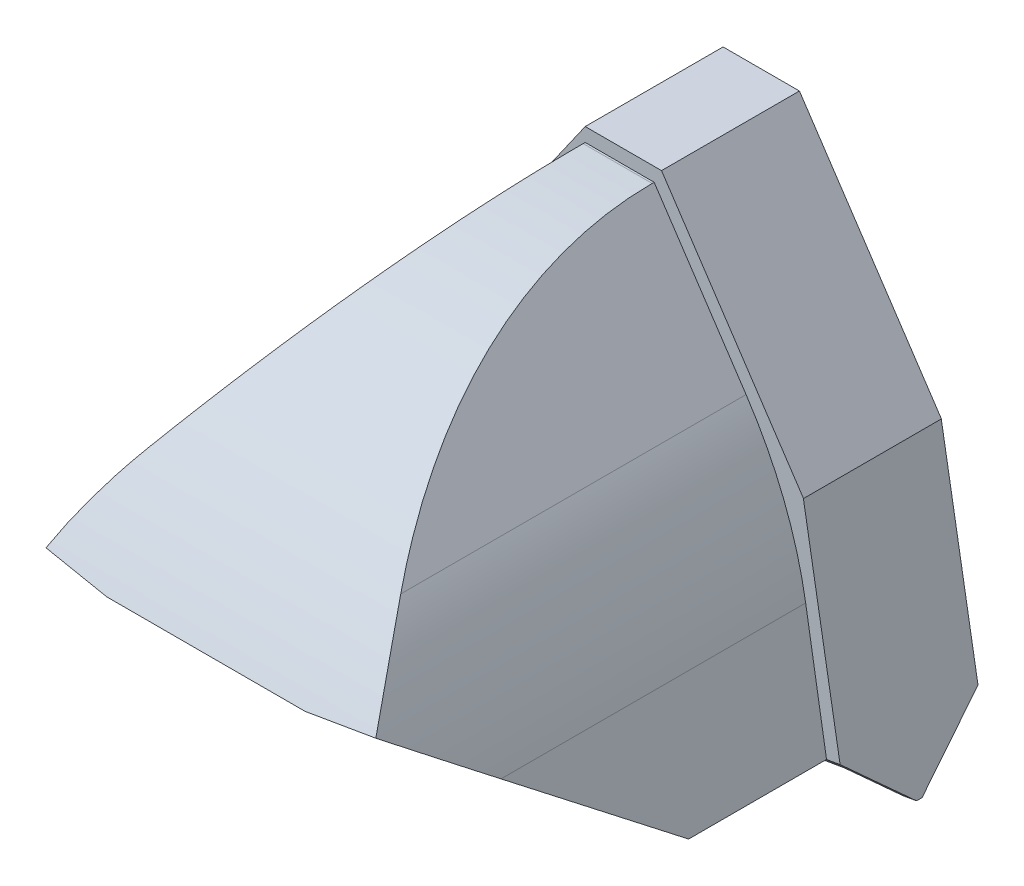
ISO-10303-21;
HEADER;
FILE_DESCRIPTION(('STEP AP214'),'2;1');
FILE_NAME('part.step','',(''),(''),'','','');
FILE_SCHEMA(('AUTOMOTIVE_DESIGN { 1 0 10303 214 1 1 1 1 }'));
ENDSEC;
DATA;
#1=APPLICATION_CONTEXT('core data for automotive mechanical design processes');
#2=APPLICATION_PROTOCOL_DEFINITION('international standard','automotive_design',2000,#1);
#3=PRODUCT_CONTEXT('',#1,'mechanical');
#4=PRODUCT('Part','Part','',(#3));
#5=PRODUCT_RELATED_PRODUCT_CATEGORY('part','',(#4));
#6=PRODUCT_DEFINITION_FORMATION('','',#4);
#7=PRODUCT_DEFINITION_CONTEXT('part definition',#1,'design');
#8=PRODUCT_DEFINITION('design','',#6,#7);
#9=PRODUCT_DEFINITION_SHAPE('','',#8);
#10=(LENGTH_UNIT() NAMED_UNIT(*) SI_UNIT(.MILLI.,.METRE.));
#11=(NAMED_UNIT(*) PLANE_ANGLE_UNIT() SI_UNIT($,.RADIAN.));
#12=(NAMED_UNIT(*) SI_UNIT($,.STERADIAN.) SOLID_ANGLE_UNIT());
#13=UNCERTAINTY_MEASURE_WITH_UNIT(LENGTH_MEASURE(1.E-05),#10,'distance_accuracy_value','');
#14=(GEOMETRIC_REPRESENTATION_CONTEXT(3) GLOBAL_UNCERTAINTY_ASSIGNED_CONTEXT((#13)) GLOBAL_UNIT_ASSIGNED_CONTEXT((#10,
#11,#12)) REPRESENTATION_CONTEXT('',''));
#15=CARTESIAN_POINT('',(0.,0.,0.));
#16=DIRECTION('',(0.,0.,1.));
#17=DIRECTION('',(1.,0.,0.));
#18=AXIS2_PLACEMENT_3D('',#15,#16,#17);
#19=CARTESIAN_POINT('',(0.,0.,101.6));
#20=DIRECTION('',(-0.986393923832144,0.164398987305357,0.));
#21=DIRECTION('',(-0.164398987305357,-0.986393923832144,0.));
#22=AXIS2_PLACEMENT_3D('',#19,#20,#21);
#23=PLANE('',#22);
#24=DIRECTION('',(0.,0.,1.));
#25=VECTOR('',#24,1.);
#26=CARTESIAN_POINT('',(0.,0.,101.6));
#27=LINE('',#26,#25);
#28=CARTESIAN_POINT('',(0.,0.,0.));
#29=VERTEX_POINT('',#28);
#30=CARTESIAN_POINT('',(0.,0.,25.4));
#31=VERTEX_POINT('',#30);
#32=EDGE_CURVE('E630',#29,#31,#27,.T.);
#33=ORIENTED_EDGE('',*,*,#32,.F.);
#34=DIRECTION('',(-0.108441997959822,-0.650651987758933,0.751593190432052));
#35=VECTOR('',#34,1.);
#36=CARTESIAN_POINT('',(-8.28083354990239,-49.6850012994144,57.3930601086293));
#37=LINE('',#36,#35);
#38=CARTESIAN_POINT('',(-0.417573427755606,-2.50544056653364,2.89413097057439));
#39=VERTEX_POINT('',#38);
#40=EDGE_CURVE('E520',#29,#39,#37,.T.);
#41=ORIENTED_EDGE('',*,*,#40,.T.);
#42=DIRECTION('',(0.,0.,-1.));
#43=VECTOR('',#42,1.);
#44=CARTESIAN_POINT('',(-0.41757342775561,-2.50544056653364,25.4));
#45=LINE('',#44,#43);
#46=CARTESIAN_POINT('',(-0.417573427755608,-2.50544056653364,22.5058690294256));
#47=VERTEX_POINT('',#46);
#48=EDGE_CURVE('E676',#47,#39,#45,.T.);
#49=ORIENTED_EDGE('',*,*,#48,.F.);
#50=DIRECTION('',(-0.108441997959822,-0.650651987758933,-0.751593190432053));
#51=VECTOR('',#50,1.);
#52=CARTESIAN_POINT('',(6.21062516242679,37.2637509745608,68.444795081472));
#53=LINE('',#52,#51);
#54=EDGE_CURVE('E539',#31,#47,#53,.T.);
#55=ORIENTED_EDGE('',*,*,#54,.F.);
#56=EDGE_LOOP('',(#33,#41,#49,#55));
#57=FACE_BOUND('',#56,.T.);
#58=ADVANCED_FACE('F234',(#57),#23,.T.);
#59=CARTESIAN_POINT('',(0.,0.,0.));
#60=DIRECTION('',(0.,0.,-1.));
#61=DIRECTION('',(-1.,0.,0.));
#62=AXIS2_PLACEMENT_3D('',#59,#60,#61);
#63=PLANE('',#62);
#64=DIRECTION('',(-0.164398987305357,-0.986393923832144,0.));
#65=VECTOR('',#64,1.);
#66=CARTESIAN_POINT('',(19.7266072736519,33.383451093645,0.));
#67=LINE('',#66,#65);
#68=CARTESIAN_POINT('',(19.6369815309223,32.8456966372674,0.));
#69=VERTEX_POINT('',#68);
#70=CARTESIAN_POINT('',(13.7669680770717,-2.37438408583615,0.));
#71=VERTEX_POINT('',#70);
#72=EDGE_CURVE('E649',#69,#71,#67,.T.);
#73=ORIENTED_EDGE('',*,*,#72,.T.);
#74=DIRECTION('',(-0.985450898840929,0.16996036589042,0.));
#75=VECTOR('',#74,1.);
#76=CARTESIAN_POINT('',(20.5249713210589,-3.53993450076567,0.));
#77=LINE('',#76,#75);
#78=EDGE_CURVE('E516',#71,#29,#77,.T.);
#79=ORIENTED_EDGE('',*,*,#78,.T.);
#80=CARTESIAN_POINT('',(-2.50304528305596,0.431699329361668,0.));
#81=VERTEX_POINT('',#80);
#82=EDGE_CURVE('E513',#29,#81,#77,.T.);
#83=ORIENTED_EDGE('',*,*,#82,.T.);
#84=DIRECTION('',(-0.16996036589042,-0.985450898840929,0.));
#85=VECTOR('',#84,1.);
#86=CARTESIAN_POINT('',(4.23659225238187,39.5089384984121,0.));
#87=LINE('',#86,#85);
#88=CARTESIAN_POINT('',(4.23659225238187,39.5089384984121,0.));
#89=VERTEX_POINT('',#88);
#90=EDGE_CURVE('E580',#89,#81,#87,.T.);
#91=ORIENTED_EDGE('',*,*,#90,.F.);
#92=DIRECTION('',(-0.574185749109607,-0.818725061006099,0.));
#93=VECTOR('',#92,1.);
#94=CARTESIAN_POINT('',(31.75,78.74,0.));
#95=LINE('',#94,#93);
#96=CARTESIAN_POINT('',(31.75,78.74,0.));
#97=VERTEX_POINT('',#96);
#98=EDGE_CURVE('E584',#97,#89,#95,.T.);
#99=ORIENTED_EDGE('',*,*,#98,.F.);
#100=DIRECTION('',(-1.,0.,0.));
#101=VECTOR('',#100,1.);
#102=CARTESIAN_POINT('',(44.45,78.74,0.));
#103=LINE('',#102,#101);
#104=CARTESIAN_POINT('',(45.8093667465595,78.74,0.));
#105=VERTEX_POINT('',#104);
#106=EDGE_CURVE('E591',#105,#97,#103,.T.);
#107=ORIENTED_EDGE('',*,*,#106,.F.);
#108=DIRECTION('',(0.554700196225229,-0.832050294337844,0.));
#109=VECTOR('',#108,1.);
#110=CARTESIAN_POINT('',(46.5634077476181,77.6089384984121,0.));
#111=LINE('',#110,#109);
#112=CARTESIAN_POINT('',(71.9634077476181,39.5089384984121,0.));
#113=VERTEX_POINT('',#112);
#114=EDGE_CURVE('E614',#105,#113,#111,.T.);
#115=ORIENTED_EDGE('',*,*,#114,.T.);
#116=DIRECTION('',(0.832050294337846,0.554700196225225,0.));
#117=VECTOR('',#116,1.);
#118=CARTESIAN_POINT('',(69.85,38.1,0.));
#119=LINE('',#118,#117);
#120=CARTESIAN_POINT('',(71.9407307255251,39.4938204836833,0.));
#121=VERTEX_POINT('',#120);
#122=EDGE_CURVE('E613',#121,#113,#119,.T.);
#123=ORIENTED_EDGE('',*,*,#122,.F.);
#124=DIRECTION('',(-0.170579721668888,0.985343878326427,0.));
#125=VECTOR('',#124,1.);
#126=CARTESIAN_POINT('',(80.5949899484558,-10.4970064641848,0.));
#127=LINE('',#126,#125);
#128=CARTESIAN_POINT('',(78.7027734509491,0.433272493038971,0.));
#129=VERTEX_POINT('',#128);
#130=EDGE_CURVE('E587',#129,#121,#127,.T.);
#131=ORIENTED_EDGE('',*,*,#130,.F.);
#132=DIRECTION('',(0.985343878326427,0.170579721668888,0.));
#133=VECTOR('',#132,1.);
#134=CARTESIAN_POINT('',(55.6772577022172,-3.5528344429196,0.));
#135=LINE('',#134,#133);
#136=CARTESIAN_POINT('',(76.2,0.,0.));
#137=VERTEX_POINT('',#136);
#138=EDGE_CURVE('E556',#137,#129,#135,.T.);
#139=ORIENTED_EDGE('',*,*,#138,.F.);
#140=CARTESIAN_POINT('',(62.434475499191,-2.38304554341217,0.));
#141=VERTEX_POINT('',#140);
#142=EDGE_CURVE('E549',#141,#137,#135,.T.);
#143=ORIENTED_EDGE('',*,*,#142,.F.);
#144=DIRECTION('',(-0.164398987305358,0.986393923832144,0.));
#145=VECTOR('',#144,1.);
#146=CARTESIAN_POINT('',(62.420076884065,-2.29665385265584,0.));
#147=LINE('',#146,#145);
#148=CARTESIAN_POINT('',(56.5630184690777,32.8456966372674,0.));
#149=VERTEX_POINT('',#148);
#150=EDGE_CURVE('E644',#141,#149,#147,.T.);
#151=ORIENTED_EDGE('',*,*,#150,.T.);
#152=DIRECTION('',(-0.554700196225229,0.832050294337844,0.));
#153=VECTOR('',#152,1.);
#154=CARTESIAN_POINT('',(56.8654255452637,32.3920860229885,0.));
#155=LINE('',#154,#153);
#156=CARTESIAN_POINT('',(38.1,60.540224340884,0.));
#157=VERTEX_POINT('',#156);
#158=EDGE_CURVE('E678',#149,#157,#155,.T.);
#159=ORIENTED_EDGE('',*,*,#158,.T.);
#160=DIRECTION('',(-0.554700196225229,-0.832050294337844,0.));
#161=VECTOR('',#160,1.);
#162=CARTESIAN_POINT('',(39.9805581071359,63.3610615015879,0.));
#163=LINE('',#162,#161);
#164=EDGE_CURVE('E681',#157,#69,#163,.T.);
#165=ORIENTED_EDGE('',*,*,#164,.T.);
#166=EDGE_LOOP('',(#73,#79,#83,#91,#99,#107,#115,#123,#131,#139,#143,#151,#159,#165));
#167=FACE_BOUND('',#166,.T.);
#168=ADVANCED_FACE('F933',(#167),#63,.T.);
#169=CARTESIAN_POINT('',(10.8569091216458,-4.38452099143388,25.4));
#170=DIRECTION('',(-0.164398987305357,-0.986393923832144,0.));
#171=DIRECTION('',(0.986393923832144,-0.164398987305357,0.));
#172=AXIS2_PLACEMENT_3D('',#169,#170,#171);
#173=PLANE('',#172);
#174=ORIENTED_EDGE('',*,*,#48,.T.);
#175=DIRECTION('',(0.986373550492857,-0.164395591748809,-0.00642715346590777));
#176=VECTOR('',#175,1.);
#177=CARTESIAN_POINT('',(10.7137657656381,-4.36066376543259,2.82159980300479));
#178=LINE('',#177,#176);
#179=CARTESIAN_POINT('',(13.3623496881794,-4.80209441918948,2.80434178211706));
#180=VERTEX_POINT('',#179);
#181=EDGE_CURVE('E523',#39,#180,#178,.T.);
#182=ORIENTED_EDGE('',*,*,#181,.T.);
#183=DIRECTION('',(0.,0.,-1.));
#184=VECTOR('',#183,1.);
#185=CARTESIAN_POINT('',(13.3623496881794,-4.80209441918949,25.4));
#186=LINE('',#185,#184);
#187=CARTESIAN_POINT('',(13.3623496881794,-4.80209441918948,22.595658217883));
#188=VERTEX_POINT('',#187);
#189=EDGE_CURVE('E686',#188,#180,#186,.T.);
#190=ORIENTED_EDGE('',*,*,#189,.F.);
#191=DIRECTION('',(0.986373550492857,-0.164395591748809,0.00642715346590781));
#192=VECTOR('',#191,1.);
#193=CARTESIAN_POINT('',(10.8747909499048,-4.38750129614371,22.5794494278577));
#194=LINE('',#193,#192);
#195=EDGE_CURVE('E541',#47,#188,#194,.T.);
#196=ORIENTED_EDGE('',*,*,#195,.F.);
#197=EDGE_LOOP('',(#174,#182,#190,#196));
#198=FACE_BOUND('',#197,.T.);
#199=ADVANCED_FACE('F955',(#198),#173,.T.);
#200=CARTESIAN_POINT('',(19.7266072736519,33.383451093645,25.4));
#201=DIRECTION('',(0.986393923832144,-0.164398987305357,0.));
#202=DIRECTION('',(0.164398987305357,0.986393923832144,0.));
#203=AXIS2_PLACEMENT_3D('',#200,#201,#202);
#204=PLANE('',#203);
#205=ORIENTED_EDGE('',*,*,#189,.T.);
#206=DIRECTION('',(0.108441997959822,0.650651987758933,-0.751593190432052));
#207=VECTOR('',#206,1.);
#208=CARTESIAN_POINT('',(14.2898444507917,0.762874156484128,-3.62396792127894));
#209=LINE('',#208,#207);
#210=EDGE_CURVE('E526',#180,#71,#209,.T.);
#211=ORIENTED_EDGE('',*,*,#210,.T.);
#212=ORIENTED_EDGE('',*,*,#72,.F.);
#213=DIRECTION('',(0.,0.,-1.));
#214=VECTOR('',#213,1.);
#215=CARTESIAN_POINT('',(19.6369815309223,32.8456966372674,25.4));
#216=LINE('',#215,#214);
#217=CARTESIAN_POINT('',(19.6369815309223,32.8456966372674,25.4));
#218=VERTEX_POINT('',#217);
#219=EDGE_CURVE('E690',#218,#69,#216,.T.);
#220=ORIENTED_EDGE('',*,*,#219,.F.);
#221=DIRECTION('',(-0.164398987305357,-0.986393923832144,0.));
#222=VECTOR('',#221,1.);
#223=CARTESIAN_POINT('',(19.7266072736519,33.383451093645,25.4));
#224=LINE('',#223,#222);
#225=CARTESIAN_POINT('',(13.7669680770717,-2.37438408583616,25.4));
#226=VERTEX_POINT('',#225);
#227=EDGE_CURVE('E673',#218,#226,#224,.T.);
#228=ORIENTED_EDGE('',*,*,#227,.T.);
#229=DIRECTION('',(0.108441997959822,0.650651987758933,0.751593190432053));
#230=VECTOR('',#229,1.);
#231=CARTESIAN_POINT('',(16.3600528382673,13.1841244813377,43.3722329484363));
#232=LINE('',#231,#230);
#233=EDGE_CURVE('E543',#188,#226,#232,.T.);
#234=ORIENTED_EDGE('',*,*,#233,.F.);
#235=EDGE_LOOP('',(#205,#211,#212,#220,#228,#234));
#236=FACE_BOUND('',#235,.T.);
#237=ADVANCED_FACE('F1225',(#236),#204,.T.);
#238=CARTESIAN_POINT('',(6.73963753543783,39.0772391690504,25.4));
#239=DIRECTION('',(0.985450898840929,-0.16996036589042,0.));
#240=DIRECTION('',(0.16996036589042,0.985450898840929,0.));
#241=AXIS2_PLACEMENT_3D('',#238,#239,#240);
#242=PLANE('',#241);
#243=DIRECTION('',(0.112109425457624,0.650024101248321,0.751598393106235));
#244=VECTOR('',#243,1.);
#245=CARTESIAN_POINT('',(2.93241531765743,17.0025011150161,45.0593518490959));
#246=LINE('',#245,#244);
#247=CARTESIAN_POINT('',(-1.89434905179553,-10.9836664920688,12.7));
#248=VERTEX_POINT('',#247);
#249=EDGE_CURVE('E535',#248,#31,#246,.T.);
#250=ORIENTED_EDGE('',*,*,#249,.F.);
#251=DIRECTION('',(0.112109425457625,0.650024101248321,-0.751598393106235));
#252=VECTOR('',#251,1.);
#253=CARTESIAN_POINT('',(0.792179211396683,4.59315153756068,-5.31088817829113));
#254=LINE('',#253,#252);
#255=EDGE_CURVE('E517',#248,#29,#254,.T.);
#256=ORIENTED_EDGE('',*,*,#255,.T.);
#257=ORIENTED_EDGE('',*,*,#32,.T.);
#258=EDGE_LOOP('',(#250,#256,#257));
#259=FACE_BOUND('',#258,.T.);
#260=ADVANCED_FACE('F1230',(#259),#242,.T.);
#261=CARTESIAN_POINT('',(4.23659225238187,39.5089384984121,25.4));
#262=DIRECTION('',(0.985450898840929,-0.16996036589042,0.));
#263=DIRECTION('',(0.16996036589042,0.985450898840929,0.));
#264=AXIS2_PLACEMENT_3D('',#261,#262,#263);
#265=PLANE('',#264);
#266=DIRECTION('',(-0.112109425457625,-0.650024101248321,0.751598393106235));
#267=VECTOR('',#266,1.);
#268=CARTESIAN_POINT('',(-2.50304528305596,0.431699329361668,0.));
#269=LINE('',#268,#267);
#270=CARTESIAN_POINT('',(-4.39739433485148,-10.5519671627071,12.7));
#271=VERTEX_POINT('',#270);
#272=EDGE_CURVE('E509',#81,#271,#269,.T.);
#273=ORIENTED_EDGE('',*,*,#272,.T.);
#274=DIRECTION('',(-0.112109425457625,-0.650024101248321,-0.751598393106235));
#275=VECTOR('',#274,1.);
#276=CARTESIAN_POINT('',(-4.64328138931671,-11.9776502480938,11.0515363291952));
#277=LINE('',#276,#275);
#278=CARTESIAN_POINT('',(-2.50304528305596,0.431699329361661,25.4));
#279=VERTEX_POINT('',#278);
#280=EDGE_CURVE('E529',#279,#271,#277,.T.);
#281=ORIENTED_EDGE('',*,*,#280,.F.);
#282=DIRECTION('',(-0.16996036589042,-0.985450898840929,0.));
#283=VECTOR('',#282,1.);
#284=CARTESIAN_POINT('',(4.23659225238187,39.5089384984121,25.4));
#285=LINE('',#284,#283);
#286=CARTESIAN_POINT('',(4.23659225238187,39.5089384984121,25.4));
#287=VERTEX_POINT('',#286);
#288=EDGE_CURVE('E604',#287,#279,#285,.T.);
#289=ORIENTED_EDGE('',*,*,#288,.F.);
#290=DIRECTION('',(0.,0.,-1.));
#291=VECTOR('',#290,1.);
#292=CARTESIAN_POINT('',(4.23659225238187,39.5089384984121,25.4));
#293=LINE('',#292,#291);
#294=EDGE_CURVE('E576',#287,#89,#293,.T.);
#295=ORIENTED_EDGE('',*,*,#294,.T.);
#296=ORIENTED_EDGE('',*,*,#90,.T.);
#297=EDGE_LOOP('',(#273,#281,#289,#295,#296));
#298=FACE_BOUND('',#297,.T.);
#299=ADVANCED_FACE('F1193',(#298),#265,.F.);
#300=CARTESIAN_POINT('',(69.85,38.1,101.6));
#301=DIRECTION('',(0.986393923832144,0.164398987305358,0.));
#302=DIRECTION('',(-0.164398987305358,0.986393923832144,0.));
#303=AXIS2_PLACEMENT_3D('',#300,#301,#302);
#304=PLANE('',#303);
#305=DIRECTION('',(-0.110638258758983,0.663829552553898,0.73965498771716));
#306=VECTOR('',#305,1.);
#307=CARTESIAN_POINT('',(67.0882568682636,54.6704587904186,86.3151511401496));
#308=LINE('',#307,#306);
#309=CARTESIAN_POINT('',(76.6175734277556,-2.50544056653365,22.6083773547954));
#310=VERTEX_POINT('',#309);
#311=CARTESIAN_POINT('',(76.2,0.,25.4));
#312=VERTEX_POINT('',#311);
#313=EDGE_CURVE('E559',#310,#312,#308,.T.);
#314=ORIENTED_EDGE('',*,*,#313,.F.);
#315=DIRECTION('',(0.,0.,-1.));
#316=VECTOR('',#315,1.);
#317=CARTESIAN_POINT('',(76.6175734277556,-2.50544056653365,25.4));
#318=LINE('',#317,#316);
#319=CARTESIAN_POINT('',(76.6175734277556,-2.50544056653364,2.79162264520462));
#320=VERTEX_POINT('',#319);
#321=EDGE_CURVE('E700',#310,#320,#318,.T.);
#322=ORIENTED_EDGE('',*,*,#321,.T.);
#323=DIRECTION('',(0.110638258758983,-0.663829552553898,0.73965498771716));
#324=VECTOR('',#323,1.);
#325=CARTESIAN_POINT('',(81.6383669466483,-32.6302016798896,36.3573621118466));
#326=LINE('',#325,#324);
#327=EDGE_CURVE('E569',#137,#320,#326,.T.);
#328=ORIENTED_EDGE('',*,*,#327,.F.);
#329=DIRECTION('',(0.,0.,-1.));
#330=VECTOR('',#329,1.);
#331=CARTESIAN_POINT('',(76.2000000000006,-3.57353036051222E-12,101.6));
#332=LINE('',#331,#330);
#333=EDGE_CURVE('E618',#312,#137,#332,.T.);
#334=ORIENTED_EDGE('',*,*,#333,.F.);
#335=EDGE_LOOP('',(#314,#322,#328,#334));
#336=FACE_BOUND('',#335,.T.);
#337=ADVANCED_FACE('F896',(#336),#304,.T.);
#338=CARTESIAN_POINT('',(58.5755174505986,36.2209195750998,101.6));
#339=DIRECTION('',(0.986393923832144,0.164398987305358,0.));
#340=DIRECTION('',(-0.164398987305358,0.986393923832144,0.));
#341=AXIS2_PLACEMENT_3D('',#338,#339,#340);
#342=PLANE('',#341);
#343=DIRECTION('',(-0.0995037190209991,0.597022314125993,0.796029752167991));
#344=VECTOR('',#343,1.);
#345=CARTESIAN_POINT('',(58.5755174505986,36.2209195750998,101.6));
#346=LINE('',#345,#344);
#347=CARTESIAN_POINT('',(64.9255174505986,-1.87908042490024,50.8));
#348=VERTEX_POINT('',#347);
#349=CARTESIAN_POINT('',(61.4883540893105,18.7438997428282,78.2973068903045));
#350=VERTEX_POINT('',#349);
#351=EDGE_CURVE('E716',#348,#350,#346,.T.);
#352=ORIENTED_EDGE('',*,*,#351,.T.);
#353=DIRECTION('',(0.,0.,-1.));
#354=VECTOR('',#353,1.);
#355=CARTESIAN_POINT('',(61.4883540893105,18.7438997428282,25.4));
#356=LINE('',#355,#354);
#357=CARTESIAN_POINT('',(61.4883540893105,18.7438997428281,25.4));
#358=VERTEX_POINT('',#357);
#359=EDGE_CURVE('E762',#350,#358,#356,.T.);
#360=ORIENTED_EDGE('',*,*,#359,.T.);
#361=DIRECTION('',(-0.164398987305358,0.986393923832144,0.));
#362=VECTOR('',#361,1.);
#363=CARTESIAN_POINT('',(64.9255174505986,-1.87908042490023,25.4));
#364=LINE('',#363,#362);
#365=CARTESIAN_POINT('',(64.9255174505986,-1.87908042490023,25.4));
#366=VERTEX_POINT('',#365);
#367=EDGE_CURVE('E660',#366,#358,#364,.T.);
#368=ORIENTED_EDGE('',*,*,#367,.F.);
#369=DIRECTION('',(0.,0.,-1.));
#370=VECTOR('',#369,1.);
#371=CARTESIAN_POINT('',(64.9255174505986,-1.87908042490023,101.6));
#372=LINE('',#371,#370);
#373=EDGE_CURVE('E736',#348,#366,#372,.T.);
#374=ORIENTED_EDGE('',*,*,#373,.F.);
#375=EDGE_LOOP('',(#352,#360,#368,#374));
#376=FACE_BOUND('',#375,.T.);
#377=ADVANCED_FACE('F822',(#376),#342,.F.);
#378=CARTESIAN_POINT('',(76.2,0.,101.6));
#379=DIRECTION('',(0.164398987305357,-0.986393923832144,0.));
#380=DIRECTION('',(0.986393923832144,0.164398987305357,0.));
#381=AXIS2_PLACEMENT_3D('',#378,#379,#380);
#382=PLANE('',#381);
#383=DIRECTION('',(-0.986393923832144,-0.164398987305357,0.));
#384=VECTOR('',#383,1.);
#385=CARTESIAN_POINT('',(76.2,0.,25.4));
#386=LINE('',#385,#384);
#387=EDGE_CURVE('E663',#312,#366,#386,.T.);
#388=ORIENTED_EDGE('',*,*,#387,.F.);
#389=DIRECTION('',(0.,0.,-1.));
#390=VECTOR('',#389,1.);
#391=CARTESIAN_POINT('',(76.2,0.,101.6));
#392=LINE('',#391,#390);
#393=CARTESIAN_POINT('',(76.2,0.,50.8));
#394=VERTEX_POINT('',#393);
#395=EDGE_CURVE('E733',#394,#312,#392,.T.);
#396=ORIENTED_EDGE('',*,*,#395,.F.);
#397=DIRECTION('',(0.986393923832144,0.164398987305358,0.));
#398=VECTOR('',#397,1.);
#399=CARTESIAN_POINT('',(29.0977173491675,-7.85038044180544,50.8));
#400=LINE('',#399,#398);
#401=EDGE_CURVE('E714',#348,#394,#400,.T.);
#402=ORIENTED_EDGE('',*,*,#401,.F.);
#403=ORIENTED_EDGE('',*,*,#373,.T.);
#404=EDGE_LOOP('',(#388,#396,#402,#403));
#405=FACE_BOUND('',#404,.T.);
#406=ADVANCED_FACE('F886',(#405),#382,.T.);
#407=DIRECTION('',(0.164398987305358,-0.986393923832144,0.));
#408=VECTOR('',#407,1.);
#409=CARTESIAN_POINT('',(69.85,38.1,25.4));
#410=LINE('',#409,#408);
#411=CARTESIAN_POINT('',(72.3595207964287,23.0428752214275,25.4));
#412=VERTEX_POINT('',#411);
#413=EDGE_CURVE('E642',#412,#312,#410,.T.);
#414=ORIENTED_EDGE('',*,*,#413,.F.);
#415=DIRECTION('',(0.,0.,-1.));
#416=VECTOR('',#415,1.);
#417=CARTESIAN_POINT('',(72.3595207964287,23.0428752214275,101.6));
#418=LINE('',#417,#416);
#419=CARTESIAN_POINT('',(72.3595207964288,23.0428752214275,81.5238336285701));
#420=VERTEX_POINT('',#419);
#421=EDGE_CURVE('E769',#412,#420,#418,.F.);
#422=ORIENTED_EDGE('',*,*,#421,.T.);
#423=DIRECTION('',(-0.0995037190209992,0.597022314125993,0.796029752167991));
#424=VECTOR('',#423,1.);
#425=CARTESIAN_POINT('',(76.2,0.,50.8));
#426=LINE('',#425,#424);
#427=EDGE_CURVE('E711',#394,#420,#426,.T.);
#428=ORIENTED_EDGE('',*,*,#427,.F.);
#429=ORIENTED_EDGE('',*,*,#395,.T.);
#430=EDGE_LOOP('',(#414,#422,#428,#429));
#431=FACE_BOUND('',#430,.T.);
#432=ADVANCED_FACE('F891',(#431),#304,.T.);
#433=CARTESIAN_POINT('',(44.45,76.2,101.6));
#434=DIRECTION('',(0.832050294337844,0.554700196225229,0.));
#435=DIRECTION('',(-0.554700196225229,0.832050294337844,0.));
#436=AXIS2_PLACEMENT_3D('',#433,#434,#435);
#437=PLANE('',#436);
#438=DIRECTION('',(0.,0.,-1.));
#439=VECTOR('',#438,1.);
#440=CARTESIAN_POINT('',(44.45,76.2,101.6));
#441=LINE('',#440,#439);
#442=CARTESIAN_POINT('',(44.45,76.2000000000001,25.7656183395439));
#443=VERTEX_POINT('',#442);
#444=CARTESIAN_POINT('',(44.45,76.2,25.4));
#445=VERTEX_POINT('',#444);
#446=EDGE_CURVE('E731',#443,#445,#441,.T.);
#447=ORIENTED_EDGE('',*,*,#446,.F.);
#448=CARTESIAN_POINT('',(105.41,-15.24,25.7656183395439));
#449=DIRECTION('',(0.832050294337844,0.554700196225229,0.));
#450=DIRECTION('',(-0.554700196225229,0.832050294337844,0.));
#451=AXIS2_PLACEMENT_3D('',#448,#449,#450);
#452=ELLIPSE('',#451,109.897202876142,91.44);
#453=CARTESIAN_POINT('',(61.3826018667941,50.8010971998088,89.0099625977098));
#454=VERTEX_POINT('',#453);
#455=EDGE_CURVE('E785',#443,#454,#452,.T.);
#456=ORIENTED_EDGE('',*,*,#455,.T.);
#457=DIRECTION('',(0.,0.,-1.));
#458=VECTOR('',#457,1.);
#459=CARTESIAN_POINT('',(61.3826018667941,50.8010971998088,101.6));
#460=LINE('',#459,#458);
#461=CARTESIAN_POINT('',(61.3826018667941,50.8010971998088,25.4));
#462=VERTEX_POINT('',#461);
#463=EDGE_CURVE('E767',#454,#462,#460,.T.);
#464=ORIENTED_EDGE('',*,*,#463,.T.);
#465=DIRECTION('',(0.554700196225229,-0.832050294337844,0.));
#466=VECTOR('',#465,1.);
#467=CARTESIAN_POINT('',(44.45,76.2,25.4));
#468=LINE('',#467,#466);
#469=EDGE_CURVE('E639',#445,#462,#468,.T.);
#470=ORIENTED_EDGE('',*,*,#469,.F.);
#471=EDGE_LOOP('',(#447,#456,#464,#470));
#472=FACE_BOUND('',#471,.T.);
#473=ADVANCED_FACE('F859',(#472),#437,.T.);
#474=CARTESIAN_POINT('',(31.75,76.2,101.6));
#475=DIRECTION('',(0.,1.,0.));
#476=DIRECTION('',(0.,0.,1.));
#477=AXIS2_PLACEMENT_3D('',#474,#475,#476);
#478=PLANE('',#477);
#479=DIRECTION('',(0.,0.,-1.));
#480=VECTOR('',#479,1.);
#481=CARTESIAN_POINT('',(31.75,76.2,101.6));
#482=LINE('',#481,#480);
#483=CARTESIAN_POINT('',(31.75,76.2000000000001,25.7656183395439));
#484=VERTEX_POINT('',#483);
#485=CARTESIAN_POINT('',(31.75,76.2,25.4));
#486=VERTEX_POINT('',#485);
#487=EDGE_CURVE('E729',#484,#486,#482,.T.);
#488=ORIENTED_EDGE('',*,*,#487,.F.);
#489=DIRECTION('',(1.,0.,0.));
#490=VECTOR('',#489,1.);
#491=CARTESIAN_POINT('',(44.45,76.2,25.7656183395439));
#492=LINE('',#491,#490);
#493=EDGE_CURVE('E782',#484,#443,#492,.T.);
#494=ORIENTED_EDGE('',*,*,#493,.T.);
#495=ORIENTED_EDGE('',*,*,#446,.T.);
#496=DIRECTION('',(-1.,0.,0.));
#497=VECTOR('',#496,1.);
#498=CARTESIAN_POINT('',(44.45,76.2,25.4));
#499=LINE('',#498,#497);
#500=EDGE_CURVE('E592',#445,#486,#499,.T.);
#501=ORIENTED_EDGE('',*,*,#500,.T.);
#502=EDGE_LOOP('',(#488,#494,#495,#501));
#503=FACE_BOUND('',#502,.T.);
#504=ADVANCED_FACE('F851',(#503),#478,.T.);
#505=CARTESIAN_POINT('',(6.34999999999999,38.1,101.6));
#506=DIRECTION('',(-0.832050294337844,0.554700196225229,0.));
#507=DIRECTION('',(-0.554700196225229,-0.832050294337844,0.));
#508=AXIS2_PLACEMENT_3D('',#505,#506,#507);
#509=PLANE('',#508);
#510=DIRECTION('',(0.,0.,-1.));
#511=VECTOR('',#510,1.);
#512=CARTESIAN_POINT('',(14.8173981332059,50.8010971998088,101.6));
#513=LINE('',#512,#511);
#514=CARTESIAN_POINT('',(14.8173981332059,50.8010971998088,25.4));
#515=VERTEX_POINT('',#514);
#516=CARTESIAN_POINT('',(14.8173981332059,50.8010971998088,89.0099625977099));
#517=VERTEX_POINT('',#516);
#518=EDGE_CURVE('E750',#515,#517,#513,.F.);
#519=ORIENTED_EDGE('',*,*,#518,.T.);
#520=CARTESIAN_POINT('',(-29.21,-15.24,25.7656183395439));
#521=DIRECTION('',(-0.832050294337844,0.554700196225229,0.));
#522=DIRECTION('',(-0.554700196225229,-0.832050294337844,0.));
#523=AXIS2_PLACEMENT_3D('',#520,#521,#522);
#524=ELLIPSE('',#523,109.897202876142,91.44);
#525=EDGE_CURVE('E812',#517,#484,#524,.T.);
#526=ORIENTED_EDGE('',*,*,#525,.T.);
#527=ORIENTED_EDGE('',*,*,#487,.T.);
#528=DIRECTION('',(0.554700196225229,0.832050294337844,0.));
#529=VECTOR('',#528,1.);
#530=CARTESIAN_POINT('',(6.34999999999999,38.1,25.4));
#531=LINE('',#530,#529);
#532=EDGE_CURVE('E636',#515,#486,#531,.T.);
#533=ORIENTED_EDGE('',*,*,#532,.F.);
#534=EDGE_LOOP('',(#519,#526,#527,#533));
#535=FACE_BOUND('',#534,.T.);
#536=ADVANCED_FACE('F845',(#535),#509,.T.);
#537=DIRECTION('',(-0.0995037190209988,-0.597022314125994,-0.796029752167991));
#538=VECTOR('',#537,1.);
#539=CARTESIAN_POINT('',(6.34999999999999,38.1,101.6));
#540=LINE('',#539,#538);
#541=CARTESIAN_POINT('',(3.84047920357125,23.0428752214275,81.52383362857));
#542=VERTEX_POINT('',#541);
#543=CARTESIAN_POINT('',(0.,0.,50.8));
#544=VERTEX_POINT('',#543);
#545=EDGE_CURVE('E689',#542,#544,#540,.T.);
#546=ORIENTED_EDGE('',*,*,#545,.F.);
#547=DIRECTION('',(0.,0.,-1.));
#548=VECTOR('',#547,1.);
#549=CARTESIAN_POINT('',(3.84047920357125,23.0428752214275,101.6));
#550=LINE('',#549,#548);
#551=CARTESIAN_POINT('',(3.84047920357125,23.0428752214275,25.4));
#552=VERTEX_POINT('',#551);
#553=EDGE_CURVE('E747',#542,#552,#550,.T.);
#554=ORIENTED_EDGE('',*,*,#553,.T.);
#555=DIRECTION('',(0.164398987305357,0.986393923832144,0.));
#556=VECTOR('',#555,1.);
#557=CARTESIAN_POINT('',(0.,0.,25.4));
#558=LINE('',#557,#556);
#559=EDGE_CURVE('E633',#31,#552,#558,.T.);
#560=ORIENTED_EDGE('',*,*,#559,.F.);
#561=DIRECTION('',(0.,0.,-1.));
#562=VECTOR('',#561,1.);
#563=CARTESIAN_POINT('',(0.,0.,101.6));
#564=LINE('',#563,#562);
#565=EDGE_CURVE('E726',#544,#31,#564,.T.);
#566=ORIENTED_EDGE('',*,*,#565,.F.);
#567=EDGE_LOOP('',(#546,#554,#560,#566));
#568=FACE_BOUND('',#567,.T.);
#569=ADVANCED_FACE('F951',(#568),#23,.T.);
#570=CARTESIAN_POINT('',(11.2744825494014,-1.87908042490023,101.6));
#571=DIRECTION('',(-0.164398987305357,-0.986393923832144,0.));
#572=DIRECTION('',(0.986393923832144,-0.164398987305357,0.));
#573=AXIS2_PLACEMENT_3D('',#570,#571,#572);
#574=PLANE('',#573);
#575=DIRECTION('',(-0.986393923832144,0.164398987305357,0.));
#576=VECTOR('',#575,1.);
#577=CARTESIAN_POINT('',(11.2744825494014,-1.87908042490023,25.4));
#578=LINE('',#577,#576);
#579=CARTESIAN_POINT('',(11.2744825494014,-1.87908042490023,25.4));
#580=VERTEX_POINT('',#579);
#581=EDGE_CURVE('E645',#580,#31,#578,.T.);
#582=ORIENTED_EDGE('',*,*,#581,.F.);
#583=DIRECTION('',(0.,0.,-1.));
#584=VECTOR('',#583,1.);
#585=CARTESIAN_POINT('',(11.2744825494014,-1.87908042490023,101.6));
#586=LINE('',#585,#584);
#587=CARTESIAN_POINT('',(11.2744825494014,-1.87908042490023,50.8));
#588=VERTEX_POINT('',#587);
#589=EDGE_CURVE('E723',#588,#580,#586,.T.);
#590=ORIENTED_EDGE('',*,*,#589,.F.);
#591=DIRECTION('',(-0.986393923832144,0.164398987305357,0.));
#592=VECTOR('',#591,1.);
#593=CARTESIAN_POINT('',(27.5598462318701,-4.59330770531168,50.8));
#594=LINE('',#593,#592);
#595=EDGE_CURVE('E706',#588,#544,#594,.T.);
#596=ORIENTED_EDGE('',*,*,#595,.T.);
#597=ORIENTED_EDGE('',*,*,#565,.T.);
#598=EDGE_LOOP('',(#582,#590,#596,#597));
#599=FACE_BOUND('',#598,.T.);
#600=ADVANCED_FACE('F961',(#599),#574,.T.);
#601=CARTESIAN_POINT('',(11.2744825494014,-1.87908042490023,101.6));
#602=DIRECTION('',(-0.986393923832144,0.164398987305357,0.));
#603=DIRECTION('',(-0.164398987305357,-0.986393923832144,0.));
#604=AXIS2_PLACEMENT_3D('',#601,#602,#603);
#605=PLANE('',#604);
#606=DIRECTION('',(-0.164398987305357,-0.986393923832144,0.));
#607=VECTOR('',#606,1.);
#608=CARTESIAN_POINT('',(17.2211667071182,33.8010245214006,25.4));
#609=LINE('',#608,#607);
#610=CARTESIAN_POINT('',(14.7116459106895,18.7438997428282,25.4));
#611=VERTEX_POINT('',#610);
#612=EDGE_CURVE('E648',#611,#580,#609,.T.);
#613=ORIENTED_EDGE('',*,*,#612,.F.);
#614=DIRECTION('',(0.,0.,-1.));
#615=VECTOR('',#614,1.);
#616=CARTESIAN_POINT('',(14.7116459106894,18.7438997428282,98.3734732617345));
#617=LINE('',#616,#615);
#618=CARTESIAN_POINT('',(14.7116459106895,18.7438997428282,78.2973068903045));
#619=VERTEX_POINT('',#618);
#620=EDGE_CURVE('E760',#611,#619,#617,.F.);
#621=ORIENTED_EDGE('',*,*,#620,.T.);
#622=DIRECTION('',(-0.0995037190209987,-0.597022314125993,-0.796029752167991));
#623=VECTOR('',#622,1.);
#624=CARTESIAN_POINT('',(15.298244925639,22.2634938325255,82.990099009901));
#625=LINE('',#624,#623);
#626=EDGE_CURVE('E709',#619,#588,#625,.T.);
#627=ORIENTED_EDGE('',*,*,#626,.T.);
#628=ORIENTED_EDGE('',*,*,#589,.T.);
#629=EDGE_LOOP('',(#613,#621,#627,#628));
#630=FACE_BOUND('',#629,.T.);
#631=ADVANCED_FACE('F967',(#630),#605,.F.);
#632=CARTESIAN_POINT('',(15.8603348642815,31.7597767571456,101.6));
#633=DIRECTION('',(-0.832050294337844,0.554700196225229,0.));
#634=DIRECTION('',(-0.554700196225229,-0.832050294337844,0.));
#635=AXIS2_PLACEMENT_3D('',#632,#633,#634);
#636=PLANE('',#635);
#637=DIRECTION('',(0.,0.,-1.));
#638=VECTOR('',#637,1.);
#639=CARTESIAN_POINT('',(37.8671503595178,64.77,101.6));
#640=LINE('',#639,#638);
#641=CARTESIAN_POINT('',(37.8671503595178,64.77,54.8457019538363));
#642=VERTEX_POINT('',#641);
#643=CARTESIAN_POINT('',(37.8671503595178,64.77,25.4));
#644=VERTEX_POINT('',#643);
#645=EDGE_CURVE('E721',#642,#644,#640,.T.);
#646=ORIENTED_EDGE('',*,*,#645,.F.);
#647=CARTESIAN_POINT('',(5.69381702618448,16.51,54.8457019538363));
#648=DIRECTION('',(-0.832050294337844,0.554700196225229,0.));
#649=DIRECTION('',(-0.554700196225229,-0.832050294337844,0.));
#650=AXIS2_PLACEMENT_3D('',#647,#648,#649);
#651=ELLIPSE('',#650,58.001301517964,48.26);
#652=CARTESIAN_POINT('',(25.6885648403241,46.5021217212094,92.654434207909));
#653=VERTEX_POINT('',#652);
#654=EDGE_CURVE('E257',#642,#653,#651,.F.);
#655=ORIENTED_EDGE('',*,*,#654,.T.);
#656=DIRECTION('',(0.,0.,-1.));
#657=VECTOR('',#656,1.);
#658=CARTESIAN_POINT('',(25.6885648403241,46.5021217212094,25.4));
#659=LINE('',#658,#657);
#660=CARTESIAN_POINT('',(25.6885648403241,46.5021217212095,25.4));
#661=VERTEX_POINT('',#660);
#662=EDGE_CURVE('E493',#653,#661,#659,.T.);
#663=ORIENTED_EDGE('',*,*,#662,.T.);
#664=DIRECTION('',(-0.554700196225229,-0.832050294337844,0.));
#665=VECTOR('',#664,1.);
#666=CARTESIAN_POINT('',(37.8671503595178,64.77,25.4));
#667=LINE('',#666,#665);
#668=EDGE_CURVE('E651',#644,#661,#667,.T.);
#669=ORIENTED_EDGE('',*,*,#668,.F.);
#670=EDGE_LOOP('',(#646,#655,#663,#669));
#671=FACE_BOUND('',#670,.T.);
#672=ADVANCED_FACE('F982',(#671),#636,.F.);
#673=CARTESIAN_POINT('',(31.75,64.77,101.6));
#674=DIRECTION('',(0.,1.,0.));
#675=DIRECTION('',(0.,0.,1.));
#676=AXIS2_PLACEMENT_3D('',#673,#674,#675);
#677=PLANE('',#676);
#678=DIRECTION('',(0.,0.,-1.));
#679=VECTOR('',#678,1.);
#680=CARTESIAN_POINT('',(38.3328496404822,64.77,101.6));
#681=LINE('',#680,#679);
#682=CARTESIAN_POINT('',(38.3328496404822,64.77,54.8457019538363));
#683=VERTEX_POINT('',#682);
#684=CARTESIAN_POINT('',(38.3328496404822,64.77,25.4));
#685=VERTEX_POINT('',#684);
#686=EDGE_CURVE('E719',#683,#685,#681,.T.);
#687=ORIENTED_EDGE('',*,*,#686,.F.);
#688=DIRECTION('',(-1.,0.,0.));
#689=VECTOR('',#688,1.);
#690=CARTESIAN_POINT('',(31.75,64.77,54.8457019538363));
#691=LINE('',#690,#689);
#692=EDGE_CURVE('E837',#683,#642,#691,.T.);
#693=ORIENTED_EDGE('',*,*,#692,.T.);
#694=ORIENTED_EDGE('',*,*,#645,.T.);
#695=DIRECTION('',(-1.,0.,0.));
#696=VECTOR('',#695,1.);
#697=CARTESIAN_POINT('',(38.3328496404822,64.77,25.4));
#698=LINE('',#697,#696);
#699=EDGE_CURVE('E654',#685,#644,#698,.T.);
#700=ORIENTED_EDGE('',*,*,#699,.F.);
#701=EDGE_LOOP('',(#687,#693,#694,#700));
#702=FACE_BOUND('',#701,.T.);
#703=ADVANCED_FACE('F983',(#702),#677,.F.);
#704=CARTESIAN_POINT('',(34.9396651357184,69.8597767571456,101.6));
#705=DIRECTION('',(0.832050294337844,0.554700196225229,0.));
#706=DIRECTION('',(-0.554700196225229,0.832050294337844,0.));
#707=AXIS2_PLACEMENT_3D('',#704,#705,#706);
#708=PLANE('',#707);
#709=DIRECTION('',(0.,0.,-1.));
#710=VECTOR('',#709,1.);
#711=CARTESIAN_POINT('',(50.5114351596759,46.5021217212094,98.3734732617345));
#712=LINE('',#711,#710);
#713=CARTESIAN_POINT('',(50.5114351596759,46.5021217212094,25.4));
#714=VERTEX_POINT('',#713);
#715=CARTESIAN_POINT('',(50.5114351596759,46.5021217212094,92.6544342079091));
#716=VERTEX_POINT('',#715);
#717=EDGE_CURVE('E765',#714,#716,#712,.F.);
#718=ORIENTED_EDGE('',*,*,#717,.T.);
#719=CARTESIAN_POINT('',(70.5061829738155,16.51,54.8457019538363));
#720=DIRECTION('',(0.832050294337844,0.554700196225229,0.));
#721=DIRECTION('',(-0.554700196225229,0.832050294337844,0.));
#722=AXIS2_PLACEMENT_3D('',#719,#720,#721);
#723=ELLIPSE('',#722,58.001301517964,48.26);
#724=EDGE_CURVE('E12',#716,#683,#723,.F.);
#725=ORIENTED_EDGE('',*,*,#724,.T.);
#726=ORIENTED_EDGE('',*,*,#686,.T.);
#727=DIRECTION('',(-0.554700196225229,0.832050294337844,0.));
#728=VECTOR('',#727,1.);
#729=CARTESIAN_POINT('',(58.9788332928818,33.8010245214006,25.4));
#730=LINE('',#729,#728);
#731=EDGE_CURVE('E657',#714,#685,#730,.T.);
#732=ORIENTED_EDGE('',*,*,#731,.F.);
#733=EDGE_LOOP('',(#718,#725,#726,#732));
#734=FACE_BOUND('',#733,.T.);
#735=ADVANCED_FACE('F985',(#734),#708,.F.);
#736=CARTESIAN_POINT('',(29.0977173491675,-7.85038044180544,50.8));
#737=DIRECTION('',(-0.130866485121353,0.785198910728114,-0.605257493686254));
#738=DIRECTION('',(0.,0.610507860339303,0.792010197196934));
#739=AXIS2_PLACEMENT_3D('',#736,#737,#738);
#740=PLANE('',#739);
#741=CARTESIAN_POINT('',(2.20718493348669,11.3508192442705,81.5238336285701));
#742=DIRECTION('',(-0.130866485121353,0.785198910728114,-0.605257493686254));
#743=DIRECTION('',(0.0995037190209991,-0.597022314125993,-0.796029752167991));
#744=AXIS2_PLACEMENT_3D('',#741,#742,#743);
#745=ELLIPSE('',#744,117.503708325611,71.12);
#746=CARTESIAN_POINT('',(68.4741562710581,37.1721846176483,100.693827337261));
#747=VERTEX_POINT('',#746);
#748=EDGE_CURVE('E771',#420,#747,#745,.F.);
#749=ORIENTED_EDGE('',*,*,#748,.T.);
#750=CARTESIAN_POINT('',(100.54401517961,-15.24,25.7656183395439));
#751=DIRECTION('',(-0.130866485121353,0.785198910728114,-0.605257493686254));
#752=DIRECTION('',(-0.991400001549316,-0.103647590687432,0.0798950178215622));
#753=AXIS2_PLACEMENT_3D('',#750,#751,#752);
#754=ELLIPSE('',#753,698.727408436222,91.44);
#755=CARTESIAN_POINT('',(56.3636261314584,35.8522710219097,101.6));
#756=VERTEX_POINT('',#755);
#757=EDGE_CURVE('E794',#747,#756,#754,.F.);
#758=ORIENTED_EDGE('',*,*,#757,.T.);
#759=CARTESIAN_POINT('',(-8.66398177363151,7.05184376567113,78.2973068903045));
#760=DIRECTION('',(-0.130866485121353,0.785198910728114,-0.605257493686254));
#761=DIRECTION('',(-0.0995037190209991,0.597022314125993,0.796029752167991));
#762=AXIS2_PLACEMENT_3D('',#759,#760,#761);
#763=ELLIPSE('',#762,117.503708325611,71.12);
#764=EDGE_CURVE('E778',#756,#350,#763,.T.);
#765=ORIENTED_EDGE('',*,*,#764,.T.);
#766=ORIENTED_EDGE('',*,*,#351,.F.);
#767=ORIENTED_EDGE('',*,*,#401,.T.);
#768=ORIENTED_EDGE('',*,*,#427,.T.);
#769=EDGE_LOOP('',(#749,#758,#765,#766,#767,#768));
#770=FACE_BOUND('',#769,.T.);
#771=ADVANCED_FACE('F873',(#770),#740,.F.);
#772=CARTESIAN_POINT('',(33.9098462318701,33.5066922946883,101.6));
#773=DIRECTION('',(0.130866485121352,0.785198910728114,-0.605257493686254));
#774=DIRECTION('',(0.,0.610507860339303,0.792010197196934));
#775=AXIS2_PLACEMENT_3D('',#772,#773,#774);
#776=PLANE('',#775);
#777=CARTESIAN_POINT('',(84.8639817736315,7.05184376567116,78.2973068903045));
#778=DIRECTION('',(0.130866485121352,0.785198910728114,-0.605257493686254));
#779=DIRECTION('',(0.0995037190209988,0.597022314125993,0.796029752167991));
#780=AXIS2_PLACEMENT_3D('',#777,#778,#779);
#781=ELLIPSE('',#780,117.503708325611,71.12);
#782=CARTESIAN_POINT('',(19.8363738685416,35.8522710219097,101.6));
#783=VERTEX_POINT('',#782);
#784=EDGE_CURVE('E776',#619,#783,#781,.T.);
#785=ORIENTED_EDGE('',*,*,#784,.T.);
#786=CARTESIAN_POINT('',(-24.3440151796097,-15.24,25.7656183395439));
#787=DIRECTION('',(0.130866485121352,0.785198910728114,-0.605257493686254));
#788=DIRECTION('',(-0.991400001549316,0.103647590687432,-0.0798950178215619));
#789=AXIS2_PLACEMENT_3D('',#786,#787,#788);
#790=ELLIPSE('',#789,698.727408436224,91.44);
#791=CARTESIAN_POINT('',(7.72584372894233,37.1721846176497,100.693827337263));
#792=VERTEX_POINT('',#791);
#793=EDGE_CURVE('E813',#783,#792,#790,.F.);
#794=ORIENTED_EDGE('',*,*,#793,.T.);
#795=CARTESIAN_POINT('',(73.9928150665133,11.3508192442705,81.52383362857));
#796=DIRECTION('',(0.130866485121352,0.785198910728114,-0.605257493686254));
#797=DIRECTION('',(-0.0995037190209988,-0.597022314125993,-0.796029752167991));
#798=AXIS2_PLACEMENT_3D('',#795,#796,#797);
#799=ELLIPSE('',#798,117.503708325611,71.12);
#800=EDGE_CURVE('E753',#792,#542,#799,.F.);
#801=ORIENTED_EDGE('',*,*,#800,.T.);
#802=ORIENTED_EDGE('',*,*,#545,.T.);
#803=ORIENTED_EDGE('',*,*,#595,.F.);
#804=ORIENTED_EDGE('',*,*,#626,.F.);
#805=EDGE_LOOP('',(#785,#794,#801,#802,#803,#804));
#806=FACE_BOUND('',#805,.T.);
#807=ADVANCED_FACE('F973',(#806),#776,.F.);
#808=CARTESIAN_POINT('',(39.9805581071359,63.3610615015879,25.4));
#809=DIRECTION('',(0.832050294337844,-0.554700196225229,0.));
#810=DIRECTION('',(0.554700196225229,0.832050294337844,0.));
#811=AXIS2_PLACEMENT_3D('',#808,#809,#810);
#812=PLANE('',#811);
#813=ORIENTED_EDGE('',*,*,#164,.F.);
#814=DIRECTION('',(0.,0.,-1.));
#815=VECTOR('',#814,1.);
#816=CARTESIAN_POINT('',(38.1,60.540224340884,25.4));
#817=LINE('',#816,#815);
#818=CARTESIAN_POINT('',(38.1,60.540224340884,25.4));
#819=VERTEX_POINT('',#818);
#820=EDGE_CURVE('E692',#819,#157,#817,.T.);
#821=ORIENTED_EDGE('',*,*,#820,.F.);
#822=DIRECTION('',(-0.554700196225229,-0.832050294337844,0.));
#823=VECTOR('',#822,1.);
#824=CARTESIAN_POINT('',(39.9805581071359,63.3610615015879,25.4));
#825=LINE('',#824,#823);
#826=EDGE_CURVE('E670',#819,#218,#825,.T.);
#827=ORIENTED_EDGE('',*,*,#826,.T.);
#828=ORIENTED_EDGE('',*,*,#219,.T.);
#829=EDGE_LOOP('',(#813,#821,#827,#828));
#830=FACE_BOUND('',#829,.T.);
#831=ADVANCED_FACE('F1074',(#830),#812,.T.);
#832=CARTESIAN_POINT('',(56.8654255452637,32.3920860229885,25.4));
#833=DIRECTION('',(-0.832050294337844,-0.554700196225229,0.));
#834=DIRECTION('',(0.554700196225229,-0.832050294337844,0.));
#835=AXIS2_PLACEMENT_3D('',#832,#833,#834);
#836=PLANE('',#835);
#837=ORIENTED_EDGE('',*,*,#158,.F.);
#838=DIRECTION('',(0.,0.,-1.));
#839=VECTOR('',#838,1.);
#840=CARTESIAN_POINT('',(56.5630184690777,32.8456966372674,25.4));
#841=LINE('',#840,#839);
#842=CARTESIAN_POINT('',(56.5630184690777,32.8456966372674,25.4));
#843=VERTEX_POINT('',#842);
#844=EDGE_CURVE('E694',#843,#149,#841,.T.);
#845=ORIENTED_EDGE('',*,*,#844,.F.);
#846=DIRECTION('',(-0.554700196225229,0.832050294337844,0.));
#847=VECTOR('',#846,1.);
#848=CARTESIAN_POINT('',(56.8654255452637,32.3920860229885,25.4));
#849=LINE('',#848,#847);
#850=EDGE_CURVE('E667',#843,#819,#849,.T.);
#851=ORIENTED_EDGE('',*,*,#850,.T.);
#852=ORIENTED_EDGE('',*,*,#820,.T.);
#853=EDGE_LOOP('',(#837,#845,#851,#852));
#854=FACE_BOUND('',#853,.T.);
#855=ADVANCED_FACE('F1211',(#854),#836,.T.);
#856=CARTESIAN_POINT('',(62.420076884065,-2.29665385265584,25.4));
#857=DIRECTION('',(-0.986393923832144,-0.164398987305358,0.));
#858=DIRECTION('',(0.164398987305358,-0.986393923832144,0.));
#859=AXIS2_PLACEMENT_3D('',#856,#857,#858);
#860=PLANE('',#859);
#861=DIRECTION('',(0.110638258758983,-0.663829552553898,-0.73965498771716));
#862=VECTOR('',#861,1.);
#863=CARTESIAN_POINT('',(62.4279542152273,-2.34391783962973,25.4435970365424));
#864=LINE('',#863,#862);
#865=CARTESIAN_POINT('',(62.434475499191,-2.38304554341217,25.4));
#866=VERTEX_POINT('',#865);
#867=CARTESIAN_POINT('',(62.8376503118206,-4.80209441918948,22.7046370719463));
#868=VERTEX_POINT('',#867);
#869=EDGE_CURVE('E564',#866,#868,#864,.T.);
#870=ORIENTED_EDGE('',*,*,#869,.F.);
#871=DIRECTION('',(-0.164398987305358,0.986393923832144,0.));
#872=VECTOR('',#871,1.);
#873=CARTESIAN_POINT('',(62.420076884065,-2.29665385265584,25.4));
#874=LINE('',#873,#872);
#875=EDGE_CURVE('E665',#866,#843,#874,.T.);
#876=ORIENTED_EDGE('',*,*,#875,.T.);
#877=ORIENTED_EDGE('',*,*,#844,.T.);
#878=ORIENTED_EDGE('',*,*,#150,.F.);
#879=DIRECTION('',(-0.110638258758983,0.663829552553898,-0.73965498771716));
#880=VECTOR('',#879,1.);
#881=CARTESIAN_POINT('',(64.5065413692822,-14.8154407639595,13.8524762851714));
#882=LINE('',#881,#880);
#883=CARTESIAN_POINT('',(62.8376503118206,-4.80209441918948,2.69536292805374));
#884=VERTEX_POINT('',#883);
#885=EDGE_CURVE('E573',#884,#141,#882,.T.);
#886=ORIENTED_EDGE('',*,*,#885,.F.);
#887=DIRECTION('',(0.,0.,-1.));
#888=VECTOR('',#887,1.);
#889=CARTESIAN_POINT('',(62.8376503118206,-4.80209441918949,25.4));
#890=LINE('',#889,#888);
#891=EDGE_CURVE('E697',#868,#884,#890,.T.);
#892=ORIENTED_EDGE('',*,*,#891,.F.);
#893=EDGE_LOOP('',(#870,#876,#877,#878,#886,#892));
#894=FACE_BOUND('',#893,.T.);
#895=ADVANCED_FACE('F927',(#894),#860,.T.);
#896=CARTESIAN_POINT('',(76.6175734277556,-2.50544056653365,25.4));
#897=DIRECTION('',(0.164398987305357,-0.986393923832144,0.));
#898=DIRECTION('',(0.986393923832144,0.164398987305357,0.));
#899=AXIS2_PLACEMENT_3D('',#896,#897,#898);
#900=PLANE('',#899);
#901=DIRECTION('',(0.98637050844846,0.16439508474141,-0.00689029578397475));
#902=VECTOR('',#901,1.);
#903=CARTESIAN_POINT('',(76.5986004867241,-2.50860272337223,22.6085098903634));
#904=LINE('',#903,#902);
#905=EDGE_CURVE('E562',#868,#310,#904,.T.);
#906=ORIENTED_EDGE('',*,*,#905,.F.);
#907=ORIENTED_EDGE('',*,*,#891,.T.);
#908=DIRECTION('',(-0.98637050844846,-0.16439508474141,-0.00689029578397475));
#909=VECTOR('',#908,1.);
#910=CARTESIAN_POINT('',(76.7712286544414,-2.47983136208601,2.79269600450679));
#911=LINE('',#910,#909);
#912=EDGE_CURVE('E571',#320,#884,#911,.T.);
#913=ORIENTED_EDGE('',*,*,#912,.F.);
#914=ORIENTED_EDGE('',*,*,#321,.F.);
#915=EDGE_LOOP('',(#906,#907,#913,#914));
#916=FACE_BOUND('',#915,.T.);
#917=ADVANCED_FACE('F923',(#916),#900,.T.);
#918=CARTESIAN_POINT('',(0.,0.,25.4));
#919=DIRECTION('',(0.,0.,1.));
#920=DIRECTION('',(1.,0.,0.));
#921=AXIS2_PLACEMENT_3D('',#918,#919,#920);
#922=PLANE('',#921);
#923=ORIENTED_EDGE('',*,*,#668,.T.);
#924=CARTESIAN_POINT('',(84.8639817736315,7.05184376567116,25.4));
#925=DIRECTION('',(0.,0.,1.));
#926=DIRECTION('',(1.,0.,0.));
#927=AXIS2_PLACEMENT_3D('',#924,#925,#926);
#928=CIRCLE('',#927,71.12);
#929=EDGE_CURVE('E758',#661,#611,#928,.T.);
#930=ORIENTED_EDGE('',*,*,#929,.T.);
#931=ORIENTED_EDGE('',*,*,#612,.T.);
#932=ORIENTED_EDGE('',*,*,#581,.T.);
#933=DIRECTION('',(-0.985450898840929,0.16996036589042,0.));
#934=VECTOR('',#933,1.);
#935=CARTESIAN_POINT('',(20.5249713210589,-3.53993450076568,25.4));
#936=LINE('',#935,#934);
#937=EDGE_CURVE('E532',#226,#31,#936,.T.);
#938=ORIENTED_EDGE('',*,*,#937,.F.);
#939=ORIENTED_EDGE('',*,*,#227,.F.);
#940=ORIENTED_EDGE('',*,*,#826,.F.);
#941=ORIENTED_EDGE('',*,*,#850,.F.);
#942=ORIENTED_EDGE('',*,*,#875,.F.);
#943=DIRECTION('',(0.985343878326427,0.170579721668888,0.));
#944=VECTOR('',#943,1.);
#945=CARTESIAN_POINT('',(55.6772577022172,-3.5528344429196,25.4));
#946=LINE('',#945,#944);
#947=EDGE_CURVE('E548',#866,#312,#946,.T.);
#948=ORIENTED_EDGE('',*,*,#947,.T.);
#949=ORIENTED_EDGE('',*,*,#387,.T.);
#950=ORIENTED_EDGE('',*,*,#367,.T.);
#951=CARTESIAN_POINT('',(-8.66398177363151,7.05184376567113,25.4));
#952=DIRECTION('',(0.,0.,1.));
#953=DIRECTION('',(1.,0.,0.));
#954=AXIS2_PLACEMENT_3D('',#951,#952,#953);
#955=CIRCLE('',#954,71.12);
#956=EDGE_CURVE('E756',#358,#714,#955,.T.);
#957=ORIENTED_EDGE('',*,*,#956,.T.);
#958=ORIENTED_EDGE('',*,*,#731,.T.);
#959=ORIENTED_EDGE('',*,*,#699,.T.);
#960=EDGE_LOOP('',(#923,#930,#931,#932,#938,#939,#940,#941,#942,#948,#949,#950,#957,#958,#959));
#961=FACE_BOUND('',#960,.T.);
#962=ADVANCED_FACE('F880',(#961),#922,.T.);
#963=CARTESIAN_POINT('',(78.0922164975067,-10.9302789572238,25.4));
#964=DIRECTION('',(-0.985343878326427,-0.170579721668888,0.));
#965=DIRECTION('',(0.170579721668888,-0.985343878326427,0.));
#966=AXIS2_PLACEMENT_3D('',#963,#964,#965);
#967=PLANE('',#966);
#968=DIRECTION('',(0.114796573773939,-0.663115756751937,-0.739661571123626));
#969=VECTOR('',#968,1.);
#970=CARTESIAN_POINT('',(77.0569862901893,-4.95033164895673,19.8782339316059));
#971=LINE('',#970,#969);
#972=CARTESIAN_POINT('',(78.0922164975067,-10.9302789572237,13.208));
#973=VERTEX_POINT('',#972);
#974=EDGE_CURVE('E552',#312,#973,#971,.T.);
#975=ORIENTED_EDGE('',*,*,#974,.F.);
#976=ORIENTED_EDGE('',*,*,#333,.T.);
#977=DIRECTION('',(-0.114796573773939,0.663115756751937,-0.739661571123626));
#978=VECTOR('',#977,1.);
#979=CARTESIAN_POINT('',(79.2137158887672,-17.4085552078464,19.4180867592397));
#980=LINE('',#979,#978);
#981=CARTESIAN_POINT('',(78.0922164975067,-10.9302789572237,12.192));
#982=VERTEX_POINT('',#981);
#983=EDGE_CURVE('E566',#982,#137,#980,.T.);
#984=ORIENTED_EDGE('',*,*,#983,.F.);
#985=DIRECTION('',(0.,0.,-1.));
#986=VECTOR('',#985,1.);
#987=CARTESIAN_POINT('',(78.0922164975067,-10.9302789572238,25.4));
#988=LINE('',#987,#986);
#989=EDGE_CURVE('E588',#973,#982,#988,.T.);
#990=ORIENTED_EDGE('',*,*,#989,.F.);
#991=EDGE_LOOP('',(#975,#976,#984,#990));
#992=FACE_BOUND('',#991,.T.);
#993=ADVANCED_FACE('F902',(#992),#967,.T.);
#994=CARTESIAN_POINT('',(80.5949899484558,-10.4970064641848,25.4));
#995=DIRECTION('',(-0.985343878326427,-0.170579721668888,0.));
#996=DIRECTION('',(0.170579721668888,-0.985343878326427,0.));
#997=AXIS2_PLACEMENT_3D('',#994,#995,#996);
#998=PLANE('',#997);
#999=DIRECTION('',(-0.170579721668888,0.985343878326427,0.));
#1000=VECTOR('',#999,1.);
#1001=CARTESIAN_POINT('',(80.5949899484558,-10.4970064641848,25.4));
#1002=LINE('',#1001,#1000);
#1003=CARTESIAN_POINT('',(78.7027734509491,0.433272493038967,25.4));
#1004=VERTEX_POINT('',#1003);
#1005=CARTESIAN_POINT('',(71.9407307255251,39.4938204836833,25.4));
#1006=VERTEX_POINT('',#1005);
#1007=EDGE_CURVE('E601',#1004,#1006,#1002,.T.);
#1008=ORIENTED_EDGE('',*,*,#1007,.F.);
#1009=DIRECTION('',(-0.114796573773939,0.663115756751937,0.739661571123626));
#1010=VECTOR('',#1009,1.);
#1011=CARTESIAN_POINT('',(78.7027734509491,0.433272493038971,25.4));
#1012=LINE('',#1011,#1010);
#1013=CARTESIAN_POINT('',(80.5949899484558,-10.4970064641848,13.208));
#1014=VERTEX_POINT('',#1013);
#1015=EDGE_CURVE('E546',#1014,#1004,#1012,.T.);
#1016=ORIENTED_EDGE('',*,*,#1015,.F.);
#1017=DIRECTION('',(0.,0.,-1.));
#1018=VECTOR('',#1017,1.);
#1019=CARTESIAN_POINT('',(80.5949899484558,-10.4970064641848,25.4));
#1020=LINE('',#1019,#1018);
#1021=CARTESIAN_POINT('',(80.5949899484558,-10.4970064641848,12.192));
#1022=VERTEX_POINT('',#1021);
#1023=EDGE_CURVE('E575',#1014,#1022,#1020,.T.);
#1024=ORIENTED_EDGE('',*,*,#1023,.T.);
#1025=DIRECTION('',(0.114796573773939,-0.663115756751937,0.739661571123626));
#1026=VECTOR('',#1025,1.);
#1027=CARTESIAN_POINT('',(80.5949899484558,-10.4970064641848,12.192));
#1028=LINE('',#1027,#1026);
#1029=EDGE_CURVE('E545',#129,#1022,#1028,.T.);
#1030=ORIENTED_EDGE('',*,*,#1029,.F.);
#1031=ORIENTED_EDGE('',*,*,#130,.T.);
#1032=DIRECTION('',(0.,0.,-1.));
#1033=VECTOR('',#1032,1.);
#1034=CARTESIAN_POINT('',(71.940730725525,39.4938204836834,25.4));
#1035=LINE('',#1034,#1033);
#1036=EDGE_CURVE('E610',#1006,#121,#1035,.T.);
#1037=ORIENTED_EDGE('',*,*,#1036,.F.);
#1038=EDGE_LOOP('',(#1008,#1016,#1024,#1030,#1031,#1037));
#1039=FACE_BOUND('',#1038,.T.);
#1040=ADVANCED_FACE('F914',(#1039),#998,.F.);
#1041=CARTESIAN_POINT('',(78.0922164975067,-10.9302789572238,25.4));
#1042=DIRECTION('',(-0.170579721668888,0.985343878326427,0.));
#1043=DIRECTION('',(-0.985343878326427,-0.170579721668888,0.));
#1044=AXIS2_PLACEMENT_3D('',#1041,#1042,#1043);
#1045=PLANE('',#1044);
#1046=ORIENTED_EDGE('',*,*,#1023,.F.);
#1047=DIRECTION('',(0.985343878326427,0.170579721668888,0.));
#1048=VECTOR('',#1047,1.);
#1049=CARTESIAN_POINT('',(57.5694741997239,-14.4831134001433,13.208));
#1050=LINE('',#1049,#1048);
#1051=EDGE_CURVE('E550',#973,#1014,#1050,.T.);
#1052=ORIENTED_EDGE('',*,*,#1051,.F.);
#1053=ORIENTED_EDGE('',*,*,#989,.T.);
#1054=DIRECTION('',(0.985343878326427,0.170579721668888,0.));
#1055=VECTOR('',#1054,1.);
#1056=CARTESIAN_POINT('',(78.0922164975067,-10.9302789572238,12.192));
#1057=LINE('',#1056,#1055);
#1058=EDGE_CURVE('E742',#982,#1022,#1057,.T.);
#1059=ORIENTED_EDGE('',*,*,#1058,.T.);
#1060=EDGE_LOOP('',(#1046,#1052,#1053,#1059));
#1061=FACE_BOUND('',#1060,.T.);
#1062=ADVANCED_FACE('F910',(#1061),#1045,.F.);
#1063=CARTESIAN_POINT('',(44.45,78.74,25.4));
#1064=DIRECTION('',(0.,-1.,0.));
#1065=DIRECTION('',(0.,0.,-1.));
#1066=AXIS2_PLACEMENT_3D('',#1063,#1064,#1065);
#1067=PLANE('',#1066);
#1068=ORIENTED_EDGE('',*,*,#106,.T.);
#1069=DIRECTION('',(0.,0.,-1.));
#1070=VECTOR('',#1069,1.);
#1071=CARTESIAN_POINT('',(31.75,78.74,25.4));
#1072=LINE('',#1071,#1070);
#1073=CARTESIAN_POINT('',(31.75,78.74,25.4));
#1074=VERTEX_POINT('',#1073);
#1075=EDGE_CURVE('E581',#1074,#97,#1072,.T.);
#1076=ORIENTED_EDGE('',*,*,#1075,.F.);
#1077=DIRECTION('',(-1.,0.,0.));
#1078=VECTOR('',#1077,1.);
#1079=CARTESIAN_POINT('',(44.45,78.74,25.4));
#1080=LINE('',#1079,#1078);
#1081=CARTESIAN_POINT('',(45.8093667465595,78.74,25.4));
#1082=VERTEX_POINT('',#1081);
#1083=EDGE_CURVE('E579',#1082,#1074,#1080,.T.);
#1084=ORIENTED_EDGE('',*,*,#1083,.F.);
#1085=DIRECTION('',(0.,0.,-1.));
#1086=VECTOR('',#1085,1.);
#1087=CARTESIAN_POINT('',(45.8093667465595,78.74,25.4));
#1088=LINE('',#1087,#1086);
#1089=EDGE_CURVE('E595',#1082,#105,#1088,.T.);
#1090=ORIENTED_EDGE('',*,*,#1089,.T.);
#1091=EDGE_LOOP('',(#1068,#1076,#1084,#1090));
#1092=FACE_BOUND('',#1091,.T.);
#1093=ADVANCED_FACE('F1152',(#1092),#1067,.F.);
#1094=CARTESIAN_POINT('',(31.75,78.74,25.4));
#1095=DIRECTION('',(0.818725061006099,-0.574185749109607,0.));
#1096=DIRECTION('',(0.574185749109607,0.818725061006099,0.));
#1097=AXIS2_PLACEMENT_3D('',#1094,#1095,#1096);
#1098=PLANE('',#1097);
#1099=ORIENTED_EDGE('',*,*,#98,.T.);
#1100=ORIENTED_EDGE('',*,*,#294,.F.);
#1101=DIRECTION('',(-0.574185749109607,-0.818725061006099,0.));
#1102=VECTOR('',#1101,1.);
#1103=CARTESIAN_POINT('',(31.75,78.74,25.4));
#1104=LINE('',#1103,#1102);
#1105=EDGE_CURVE('E606',#1074,#287,#1104,.T.);
#1106=ORIENTED_EDGE('',*,*,#1105,.F.);
#1107=ORIENTED_EDGE('',*,*,#1075,.T.);
#1108=EDGE_LOOP('',(#1099,#1100,#1106,#1107));
#1109=FACE_BOUND('',#1108,.T.);
#1110=ADVANCED_FACE('F1115',(#1109),#1098,.F.);
#1111=CARTESIAN_POINT('',(0.,0.,25.4));
#1112=DIRECTION('',(0.,0.,1.));
#1113=DIRECTION('',(1.,0.,0.));
#1114=AXIS2_PLACEMENT_3D('',#1111,#1112,#1113);
#1115=PLANE('',#1114);
#1116=DIRECTION('',(-0.985450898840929,0.16996036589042,0.));
#1117=VECTOR('',#1116,1.);
#1118=CARTESIAN_POINT('',(0.,0.,25.4));
#1119=LINE('',#1118,#1117);
#1120=EDGE_CURVE('E745',#31,#279,#1119,.T.);
#1121=ORIENTED_EDGE('',*,*,#1120,.F.);
#1122=ORIENTED_EDGE('',*,*,#559,.T.);
#1123=CARTESIAN_POINT('',(73.9928150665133,11.3508192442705,25.4));
#1124=DIRECTION('',(0.,0.,1.));
#1125=DIRECTION('',(1.,0.,0.));
#1126=AXIS2_PLACEMENT_3D('',#1123,#1124,#1125);
#1127=CIRCLE('',#1126,71.12);
#1128=EDGE_CURVE('E774',#552,#515,#1127,.F.);
#1129=ORIENTED_EDGE('',*,*,#1128,.T.);
#1130=ORIENTED_EDGE('',*,*,#532,.T.);
#1131=ORIENTED_EDGE('',*,*,#500,.F.);
#1132=ORIENTED_EDGE('',*,*,#469,.T.);
#1133=CARTESIAN_POINT('',(2.20718493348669,11.3508192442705,25.4));
#1134=DIRECTION('',(0.,0.,1.));
#1135=DIRECTION('',(1.,0.,0.));
#1136=AXIS2_PLACEMENT_3D('',#1133,#1134,#1135);
#1137=CIRCLE('',#1136,71.12);
#1138=EDGE_CURVE('E780',#462,#412,#1137,.F.);
#1139=ORIENTED_EDGE('',*,*,#1138,.T.);
#1140=ORIENTED_EDGE('',*,*,#413,.T.);
#1141=DIRECTION('',(-0.985343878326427,-0.170579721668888,0.));
#1142=VECTOR('',#1141,1.);
#1143=CARTESIAN_POINT('',(2.2172250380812,-12.8076719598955,25.4));
#1144=LINE('',#1143,#1142);
#1145=EDGE_CURVE('E739',#1004,#312,#1144,.T.);
#1146=ORIENTED_EDGE('',*,*,#1145,.F.);
#1147=ORIENTED_EDGE('',*,*,#1007,.T.);
#1148=DIRECTION('',(0.832050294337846,0.554700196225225,0.));
#1149=VECTOR('',#1148,1.);
#1150=CARTESIAN_POINT('',(69.85,38.1,25.4));
#1151=LINE('',#1150,#1149);
#1152=CARTESIAN_POINT('',(71.9634077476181,39.5089384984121,25.4));
#1153=VERTEX_POINT('',#1152);
#1154=EDGE_CURVE('E603',#1006,#1153,#1151,.T.);
#1155=ORIENTED_EDGE('',*,*,#1154,.T.);
#1156=DIRECTION('',(0.554700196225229,-0.832050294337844,0.));
#1157=VECTOR('',#1156,1.);
#1158=CARTESIAN_POINT('',(46.5634077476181,77.6089384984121,25.4));
#1159=LINE('',#1158,#1157);
#1160=EDGE_CURVE('E619',#1082,#1153,#1159,.T.);
#1161=ORIENTED_EDGE('',*,*,#1160,.F.);
#1162=ORIENTED_EDGE('',*,*,#1083,.T.);
#1163=ORIENTED_EDGE('',*,*,#1105,.T.);
#1164=ORIENTED_EDGE('',*,*,#288,.T.);
#1165=EDGE_LOOP('',(#1121,#1122,#1129,#1130,#1131,#1132,#1139,#1140,#1146,#1147,#1155,#1161,
#1162,#1163,#1164));
#1166=FACE_BOUND('',#1165,.T.);
#1167=ADVANCED_FACE('F868',(#1166),#1115,.T.);
#1168=CARTESIAN_POINT('',(69.85,38.1,25.4));
#1169=DIRECTION('',(-0.554700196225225,0.832050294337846,0.));
#1170=DIRECTION('',(-0.832050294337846,-0.554700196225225,0.));
#1171=AXIS2_PLACEMENT_3D('',#1168,#1169,#1170);
#1172=PLANE('',#1171);
#1173=ORIENTED_EDGE('',*,*,#1154,.F.);
#1174=ORIENTED_EDGE('',*,*,#1036,.T.);
#1175=ORIENTED_EDGE('',*,*,#122,.T.);
#1176=DIRECTION('',(0.,0.,-1.));
#1177=VECTOR('',#1176,1.);
#1178=CARTESIAN_POINT('',(71.9634077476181,39.5089384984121,25.4));
#1179=LINE('',#1178,#1177);
#1180=EDGE_CURVE('E615',#1153,#113,#1179,.T.);
#1181=ORIENTED_EDGE('',*,*,#1180,.F.);
#1182=EDGE_LOOP('',(#1173,#1174,#1175,#1181));
#1183=FACE_BOUND('',#1182,.T.);
#1184=ADVANCED_FACE('F1114',(#1183),#1172,.F.);
#1185=CARTESIAN_POINT('',(46.5634077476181,77.6089384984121,25.4));
#1186=DIRECTION('',(0.832050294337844,0.554700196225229,0.));
#1187=DIRECTION('',(-0.554700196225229,0.832050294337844,0.));
#1188=AXIS2_PLACEMENT_3D('',#1185,#1186,#1187);
#1189=PLANE('',#1188);
#1190=ORIENTED_EDGE('',*,*,#114,.F.);
#1191=ORIENTED_EDGE('',*,*,#1089,.F.);
#1192=ORIENTED_EDGE('',*,*,#1160,.T.);
#1193=ORIENTED_EDGE('',*,*,#1180,.T.);
#1194=EDGE_LOOP('',(#1190,#1191,#1192,#1193));
#1195=FACE_BOUND('',#1194,.T.);
#1196=ADVANCED_FACE('F944',(#1195),#1189,.T.);
#1197=CARTESIAN_POINT('',(55.6772577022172,-3.5528344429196,25.4));
#1198=DIRECTION('',(-0.12617126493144,0.728821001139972,-0.672979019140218));
#1199=DIRECTION('',(0.,0.678400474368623,0.734692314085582));
#1200=AXIS2_PLACEMENT_3D('',#1197,#1198,#1199);
#1201=PLANE('',#1200);
#1202=ORIENTED_EDGE('',*,*,#974,.T.);
#1203=ORIENTED_EDGE('',*,*,#1051,.T.);
#1204=ORIENTED_EDGE('',*,*,#1015,.T.);
#1205=ORIENTED_EDGE('',*,*,#1145,.T.);
#1206=EDGE_LOOP('',(#1202,#1203,#1204,#1205));
#1207=FACE_BOUND('',#1206,.T.);
#1208=ADVANCED_FACE('F905',(#1207),#1201,.F.);
#1209=CARTESIAN_POINT('',(57.5694741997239,-14.4831134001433,12.192));
#1210=DIRECTION('',(-0.12617126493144,0.728821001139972,0.672979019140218));
#1211=DIRECTION('',(0.,-0.678400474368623,0.734692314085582));
#1212=AXIS2_PLACEMENT_3D('',#1209,#1210,#1211);
#1213=PLANE('',#1212);
#1214=ORIENTED_EDGE('',*,*,#983,.T.);
#1215=ORIENTED_EDGE('',*,*,#138,.T.);
#1216=ORIENTED_EDGE('',*,*,#1029,.T.);
#1217=ORIENTED_EDGE('',*,*,#1058,.F.);
#1218=EDGE_LOOP('',(#1214,#1215,#1216,#1217));
#1219=FACE_BOUND('',#1218,.T.);
#1220=ADVANCED_FACE('F936',(#1219),#1213,.F.);
#1221=ORIENTED_EDGE('',*,*,#869,.T.);
#1222=ORIENTED_EDGE('',*,*,#905,.T.);
#1223=ORIENTED_EDGE('',*,*,#313,.T.);
#1224=ORIENTED_EDGE('',*,*,#947,.F.);
#1225=EDGE_LOOP('',(#1221,#1222,#1223,#1224));
#1226=FACE_BOUND('',#1225,.T.);
#1227=ADVANCED_FACE('F918',(#1226),#1201,.F.);
#1228=ORIENTED_EDGE('',*,*,#885,.T.);
#1229=ORIENTED_EDGE('',*,*,#142,.T.);
#1230=ORIENTED_EDGE('',*,*,#327,.T.);
#1231=ORIENTED_EDGE('',*,*,#912,.T.);
#1232=EDGE_LOOP('',(#1228,#1229,#1230,#1231));
#1233=FACE_BOUND('',#1232,.T.);
#1234=ADVANCED_FACE('F931',(#1233),#1213,.F.);
#1235=CARTESIAN_POINT('',(18.3847352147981,-15.9492840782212,11.0515363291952));
#1236=DIRECTION('',(0.127741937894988,0.740663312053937,-0.659620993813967));
#1237=DIRECTION('',(0.,0.665069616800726,0.746781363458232));
#1238=AXIS2_PLACEMENT_3D('',#1235,#1236,#1237);
#1239=PLANE('',#1238);
#1240=ORIENTED_EDGE('',*,*,#249,.T.);
#1241=ORIENTED_EDGE('',*,*,#1120,.T.);
#1242=ORIENTED_EDGE('',*,*,#280,.T.);
#1243=DIRECTION('',(-0.985450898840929,0.16996036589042,0.));
#1244=VECTOR('',#1243,1.);
#1245=CARTESIAN_POINT('',(18.6306222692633,-14.5236009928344,12.7));
#1246=LINE('',#1245,#1244);
#1247=EDGE_CURVE('E533',#248,#271,#1246,.T.);
#1248=ORIENTED_EDGE('',*,*,#1247,.F.);
#1249=EDGE_LOOP('',(#1240,#1241,#1242,#1248));
#1250=FACE_BOUND('',#1249,.T.);
#1251=ADVANCED_FACE('F947',(#1250),#1239,.F.);
#1252=ORIENTED_EDGE('',*,*,#233,.T.);
#1253=ORIENTED_EDGE('',*,*,#937,.T.);
#1254=ORIENTED_EDGE('',*,*,#54,.T.);
#1255=ORIENTED_EDGE('',*,*,#195,.T.);
#1256=EDGE_LOOP('',(#1252,#1253,#1254,#1255));
#1257=FACE_BOUND('',#1256,.T.);
#1258=ADVANCED_FACE('F1288',(#1257),#1239,.F.);
#1259=CARTESIAN_POINT('',(20.5249713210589,-3.53993450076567,0.));
#1260=DIRECTION('',(-0.127741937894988,-0.740663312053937,-0.659620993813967));
#1261=DIRECTION('',(0.,0.665069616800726,-0.746781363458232));
#1262=AXIS2_PLACEMENT_3D('',#1259,#1260,#1261);
#1263=PLANE('',#1262);
#1264=ORIENTED_EDGE('',*,*,#1247,.T.);
#1265=ORIENTED_EDGE('',*,*,#272,.F.);
#1266=ORIENTED_EDGE('',*,*,#82,.F.);
#1267=ORIENTED_EDGE('',*,*,#255,.F.);
#1268=EDGE_LOOP('',(#1264,#1265,#1266,#1267));
#1269=FACE_BOUND('',#1268,.T.);
#1270=ADVANCED_FACE('F1241',(#1269),#1263,.T.);
#1271=ORIENTED_EDGE('',*,*,#181,.F.);
#1272=ORIENTED_EDGE('',*,*,#40,.F.);
#1273=ORIENTED_EDGE('',*,*,#78,.F.);
#1274=ORIENTED_EDGE('',*,*,#210,.F.);
#1275=EDGE_LOOP('',(#1271,#1272,#1273,#1274));
#1276=FACE_BOUND('',#1275,.T.);
#1277=ADVANCED_FACE('F820',(#1276),#1263,.T.);
#1278=CARTESIAN_POINT('',(73.9928150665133,11.3508192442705,101.6));
#1279=DIRECTION('',(0.,0.,-1.));
#1280=DIRECTION('',(-1.,0.,0.));
#1281=AXIS2_PLACEMENT_3D('',#1278,#1279,#1280);
#1282=CYLINDRICAL_SURFACE('',#1281,71.12);
#1283=ORIENTED_EDGE('',*,*,#800,.F.);
#1284=CARTESIAN_POINT('',(7.72584372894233,37.1721846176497,100.693827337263));
#1285=CARTESIAN_POINT('',(8.2169130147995,38.4324235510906,99.8123051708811));
#1286=CARTESIAN_POINT('',(8.73756889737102,39.6623826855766,98.9045908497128));
#1287=CARTESIAN_POINT('',(9.82980894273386,42.0573342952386,97.043812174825));
#1288=CARTESIAN_POINT('',(10.4012342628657,43.2225120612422,96.0908933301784));
#1289=CARTESIAN_POINT('',(11.5897697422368,45.4910328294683,94.1414365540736));
#1290=CARTESIAN_POINT('',(12.2068760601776,46.5943810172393,93.144902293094));
#1291=CARTESIAN_POINT('',(13.4827283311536,48.7426462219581,91.1084880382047));
#1292=CARTESIAN_POINT('',(14.1415949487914,49.7873757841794,90.0684856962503));
#1293=CARTESIAN_POINT('',(14.8173981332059,50.8010971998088,89.0099625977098));
#1294=B_SPLINE_CURVE_WITH_KNOTS('',3,(#1284,#1285,#1286,#1287,#1288,#1289,#1290,#1291,#1292,
#1293),.UNSPECIFIED.,.F.,.F.,(4,2,2,2,4),(0.,4.84208791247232,9.66952669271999,14.4965599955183,
19.3382398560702),.UNSPECIFIED.);
#1295=EDGE_CURVE('E805',#792,#517,#1294,.T.);
#1296=ORIENTED_EDGE('',*,*,#1295,.T.);
#1297=ORIENTED_EDGE('',*,*,#518,.F.);
#1298=ORIENTED_EDGE('',*,*,#1128,.F.);
#1299=ORIENTED_EDGE('',*,*,#553,.F.);
#1300=EDGE_LOOP('',(#1283,#1296,#1297,#1298,#1299));
#1301=FACE_BOUND('',#1300,.T.);
#1302=ADVANCED_FACE('F815',(#1301),#1282,.T.);
#1303=CARTESIAN_POINT('',(84.8639817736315,7.05184376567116,101.6));
#1304=DIRECTION('',(0.,0.,1.));
#1305=DIRECTION('',(1.,0.,0.));
#1306=AXIS2_PLACEMENT_3D('',#1303,#1304,#1305);
#1307=CYLINDRICAL_SURFACE('',#1306,71.12);
#1308=ORIENTED_EDGE('',*,*,#662,.F.);
#1309=CARTESIAN_POINT('',(25.6885648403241,46.5021217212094,92.654434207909));
#1310=CARTESIAN_POINT('',(25.1561605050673,45.7035774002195,93.287836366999));
#1311=CARTESIAN_POINT('',(24.6316144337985,44.8816710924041,93.8986490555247));
#1312=CARTESIAN_POINT('',(23.6049377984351,43.1953535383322,95.0697026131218));
#1313=CARTESIAN_POINT('',(23.1027264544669,42.3311241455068,95.6301347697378));
#1314=CARTESIAN_POINT('',(22.1230705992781,40.5579407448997,96.7001629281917));
#1315=CARTESIAN_POINT('',(21.6456282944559,39.64898276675,97.209754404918));
#1316=CARTESIAN_POINT('',(20.9507332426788,38.2515760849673,97.9340801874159));
#1317=CARTESIAN_POINT('',(20.7222025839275,37.7791148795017,98.1692832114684));
#1318=CARTESIAN_POINT('',(20.2731438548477,36.8235882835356,98.625445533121));
#1319=CARTESIAN_POINT('',(20.0526163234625,36.3405221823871,98.8464038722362));
#1320=CARTESIAN_POINT('',(19.8363738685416,35.8522710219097,99.06));
#1321=B_SPLINE_CURVE_WITH_KNOTS('',3,(#1309,#1310,#1311,#1312,#1313,#1314,#1315,#1316,#1317,
#1318,#1319,#1320),.UNSPECIFIED.,.F.,.F.,(4,2,2,2,2,4),(0.,3.44947552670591,6.88524574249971,
10.3213214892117,12.0464023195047,13.7715991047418),.UNSPECIFIED.);
#1322=CARTESIAN_POINT('',(19.8363738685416,35.8522710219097,99.06));
#1323=VERTEX_POINT('',#1322);
#1324=EDGE_CURVE('E486',#653,#1323,#1321,.T.);
#1325=ORIENTED_EDGE('',*,*,#1324,.T.);
#1326=DIRECTION('',(0.,0.,1.));
#1327=VECTOR('',#1326,1.);
#1328=CARTESIAN_POINT('',(19.8363738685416,35.8522710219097,99.06));
#1329=LINE('',#1328,#1327);
#1330=EDGE_CURVE('E490',#1323,#783,#1329,.T.);
#1331=ORIENTED_EDGE('',*,*,#1330,.T.);
#1332=ORIENTED_EDGE('',*,*,#784,.F.);
#1333=ORIENTED_EDGE('',*,*,#620,.F.);
#1334=ORIENTED_EDGE('',*,*,#929,.F.);
#1335=EDGE_LOOP('',(#1308,#1325,#1331,#1332,#1333,#1334));
#1336=FACE_BOUND('',#1335,.T.);
#1337=ADVANCED_FACE('F488',(#1336),#1307,.F.);
#1338=CARTESIAN_POINT('',(-8.66398177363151,7.05184376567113,101.6));
#1339=DIRECTION('',(0.,0.,1.));
#1340=DIRECTION('',(1.,0.,0.));
#1341=AXIS2_PLACEMENT_3D('',#1338,#1339,#1340);
#1342=CYLINDRICAL_SURFACE('',#1341,71.12);
#1343=DIRECTION('',(0.,0.,1.));
#1344=VECTOR('',#1343,1.);
#1345=CARTESIAN_POINT('',(56.3636261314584,35.8522710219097,99.06));
#1346=LINE('',#1345,#1344);
#1347=CARTESIAN_POINT('',(56.3636261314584,35.8522710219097,99.06));
#1348=VERTEX_POINT('',#1347);
#1349=EDGE_CURVE('E503',#1348,#756,#1346,.T.);
#1350=ORIENTED_EDGE('',*,*,#1349,.F.);
#1351=CARTESIAN_POINT('',(56.3636261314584,35.8522710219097,99.06));
#1352=CARTESIAN_POINT('',(56.1473836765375,36.340522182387,98.8464038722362));
#1353=CARTESIAN_POINT('',(55.9268561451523,36.8235882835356,98.625445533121));
#1354=CARTESIAN_POINT('',(55.4777974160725,37.7791148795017,98.1692832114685));
#1355=CARTESIAN_POINT('',(55.2492667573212,38.2515760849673,97.9340801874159));
#1356=CARTESIAN_POINT('',(54.5543717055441,39.64898276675,97.209754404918));
#1357=CARTESIAN_POINT('',(54.0769294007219,40.5579407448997,96.7001629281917));
#1358=CARTESIAN_POINT('',(53.0972735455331,42.3311241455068,95.6301347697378));
#1359=CARTESIAN_POINT('',(52.5950622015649,43.1953535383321,95.0697026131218));
#1360=CARTESIAN_POINT('',(51.5683855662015,44.881671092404,93.8986490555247));
#1361=CARTESIAN_POINT('',(51.0438394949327,45.7035774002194,93.2878363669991));
#1362=CARTESIAN_POINT('',(50.5114351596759,46.5021217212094,92.6544342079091));
#1363=B_SPLINE_CURVE_WITH_KNOTS('',3,(#1351,#1352,#1353,#1354,#1355,#1356,#1357,#1358,#1359,
#1360,#1361,#1362),.UNSPECIFIED.,.F.,.F.,(4,2,2,2,2,4),(0.,1.72519678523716,3.45027761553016,
6.88635336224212,10.3221235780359,13.7715991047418),.UNSPECIFIED.);
#1364=EDGE_CURVE('E243',#1348,#716,#1363,.T.);
#1365=ORIENTED_EDGE('',*,*,#1364,.T.);
#1366=ORIENTED_EDGE('',*,*,#717,.F.);
#1367=ORIENTED_EDGE('',*,*,#956,.F.);
#1368=ORIENTED_EDGE('',*,*,#359,.F.);
#1369=ORIENTED_EDGE('',*,*,#764,.F.);
#1370=EDGE_LOOP('',(#1350,#1365,#1366,#1367,#1368,#1369));
#1371=FACE_BOUND('',#1370,.T.);
#1372=ADVANCED_FACE('F826',(#1371),#1342,.F.);
#1373=CARTESIAN_POINT('',(2.20718493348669,11.3508192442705,101.6));
#1374=DIRECTION('',(0.,0.,-1.));
#1375=DIRECTION('',(-1.,0.,0.));
#1376=AXIS2_PLACEMENT_3D('',#1373,#1374,#1375);
#1377=CYLINDRICAL_SURFACE('',#1376,71.12);
#1378=ORIENTED_EDGE('',*,*,#463,.F.);
#1379=CARTESIAN_POINT('',(61.3826018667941,50.8010971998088,89.0099625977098));
#1380=CARTESIAN_POINT('',(62.0584050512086,49.7873757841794,90.0684856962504));
#1381=CARTESIAN_POINT('',(62.7172716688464,48.7426462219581,91.1084880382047));
#1382=CARTESIAN_POINT('',(63.9931239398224,46.5943810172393,93.144902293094));
#1383=CARTESIAN_POINT('',(64.6102302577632,45.4910328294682,94.1414365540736));
#1384=CARTESIAN_POINT('',(65.7987657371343,43.2225120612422,96.0908933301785));
#1385=CARTESIAN_POINT('',(66.3701910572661,42.0573342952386,97.0438121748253));
#1386=CARTESIAN_POINT('',(67.4624311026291,39.6623826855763,98.9045908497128));
#1387=CARTESIAN_POINT('',(67.9830869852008,38.43242355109,99.8123051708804));
#1388=CARTESIAN_POINT('',(68.4741562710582,37.1721846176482,100.693827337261));
#1389=B_SPLINE_CURVE_WITH_KNOTS('',3,(#1379,#1380,#1381,#1382,#1383,#1384,#1385,#1386,#1387,
#1388),.UNSPECIFIED.,.F.,.F.,(4,2,2,2,4),(0.,4.8416798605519,9.66871316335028,14.4961519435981,
19.3382398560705),.UNSPECIFIED.);
#1390=EDGE_CURVE('E787',#454,#747,#1389,.T.);
#1391=ORIENTED_EDGE('',*,*,#1390,.T.);
#1392=ORIENTED_EDGE('',*,*,#748,.F.);
#1393=ORIENTED_EDGE('',*,*,#421,.F.);
#1394=ORIENTED_EDGE('',*,*,#1138,.F.);
#1395=EDGE_LOOP('',(#1378,#1391,#1392,#1393,#1394));
#1396=FACE_BOUND('',#1395,.T.);
#1397=ADVANCED_FACE('F796',(#1396),#1377,.T.);
#1398=CARTESIAN_POINT('',(19.8363738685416,35.8522710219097,99.06));
#1399=DIRECTION('',(0.,-1.,0.));
#1400=DIRECTION('',(0.,0.,-1.));
#1401=AXIS2_PLACEMENT_3D('',#1398,#1399,#1400);
#1402=PLANE('',#1401);
#1403=DIRECTION('',(1.,0.,0.));
#1404=VECTOR('',#1403,1.);
#1405=CARTESIAN_POINT('',(19.8363738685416,35.8522710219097,101.6));
#1406=LINE('',#1405,#1404);
#1407=EDGE_CURVE('E502',#783,#756,#1406,.T.);
#1408=ORIENTED_EDGE('',*,*,#1407,.F.);
#1409=ORIENTED_EDGE('',*,*,#1330,.F.);
#1410=DIRECTION('',(1.,0.,0.));
#1411=VECTOR('',#1410,1.);
#1412=CARTESIAN_POINT('',(19.8363738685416,35.8522710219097,99.06));
#1413=LINE('',#1412,#1411);
#1414=EDGE_CURVE('E500',#1323,#1348,#1413,.T.);
#1415=ORIENTED_EDGE('',*,*,#1414,.T.);
#1416=ORIENTED_EDGE('',*,*,#1349,.T.);
#1417=EDGE_LOOP('',(#1408,#1409,#1415,#1416));
#1418=FACE_BOUND('',#1417,.T.);
#1419=ADVANCED_FACE('F498',(#1418),#1402,.T.);
#1420=CARTESIAN_POINT('',(0.,-15.24,25.7656183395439));
#1421=DIRECTION('',(-1.,0.,0.));
#1422=DIRECTION('',(0.,0.,1.));
#1423=AXIS2_PLACEMENT_3D('',#1420,#1421,#1422);
#1424=CYLINDRICAL_SURFACE('',#1423,91.44);
#1425=ORIENTED_EDGE('',*,*,#793,.F.);
#1426=ORIENTED_EDGE('',*,*,#1407,.T.);
#1427=ORIENTED_EDGE('',*,*,#757,.F.);
#1428=ORIENTED_EDGE('',*,*,#1390,.F.);
#1429=ORIENTED_EDGE('',*,*,#455,.F.);
#1430=ORIENTED_EDGE('',*,*,#493,.F.);
#1431=ORIENTED_EDGE('',*,*,#525,.F.);
#1432=ORIENTED_EDGE('',*,*,#1295,.F.);
#1433=EDGE_LOOP('',(#1425,#1426,#1427,#1428,#1429,#1430,#1431,#1432));
#1434=FACE_BOUND('',#1433,.T.);
#1435=ADVANCED_FACE('F799',(#1434),#1424,.T.);
#1436=CARTESIAN_POINT('',(76.7001611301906,16.51,54.8457019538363));
#1437=DIRECTION('',(-1.,0.,0.));
#1438=DIRECTION('',(0.,0.,1.));
#1439=AXIS2_PLACEMENT_3D('',#1436,#1437,#1438);
#1440=CYLINDRICAL_SURFACE('',#1439,48.26);
#1441=ORIENTED_EDGE('',*,*,#1364,.F.);
#1442=ORIENTED_EDGE('',*,*,#1414,.F.);
#1443=ORIENTED_EDGE('',*,*,#1324,.F.);
#1444=ORIENTED_EDGE('',*,*,#654,.F.);
#1445=ORIENTED_EDGE('',*,*,#692,.F.);
#1446=ORIENTED_EDGE('',*,*,#724,.F.);
#1447=EDGE_LOOP('',(#1441,#1442,#1443,#1444,#1445,#1446));
#1448=FACE_BOUND('',#1447,.T.);
#1449=ADVANCED_FACE('F236',(#1448),#1440,.F.);
#1450=CLOSED_SHELL('',(#58,#168,#199,#237,#260,#299,#337,#377,#406,#432,#473,#504,#536,#569,
#600,#631,#672,#703,#735,#771,#807,#831,#855,#895,#917,#962,#993,#1040,#1062,#1093,#1110,#1167,
#1184,#1196,#1208,#1220,#1227,#1234,#1251,#1258,#1270,#1277,#1302,#1337,#1372,#1397,#1419,#1435,#1449));
#1451=MANIFOLD_SOLID_BREP('B2',#1450);
#1452=ADVANCED_BREP_SHAPE_REPRESENTATION('',(#18,#1451),#14);
#1453=SHAPE_DEFINITION_REPRESENTATION(#9,#1452);
ENDSEC;
END-ISO-10303-21;
